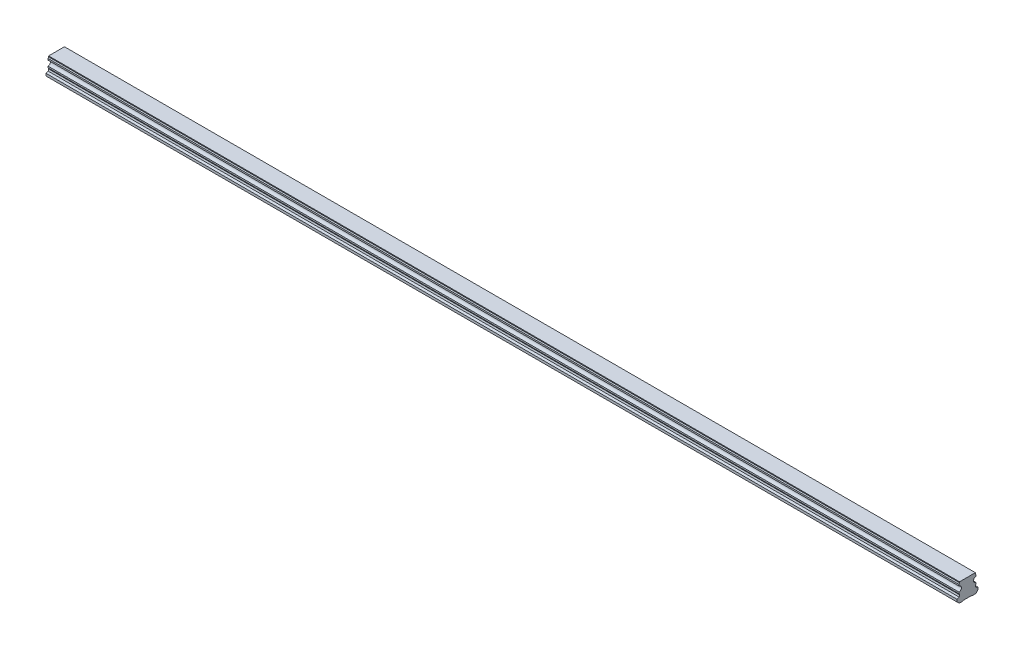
ISO-10303-21;
HEADER;
FILE_DESCRIPTION(('STEP AP214'),'2;1');
FILE_NAME('part.step','',(''),(''),'','','');
FILE_SCHEMA(('AUTOMOTIVE_DESIGN { 1 0 10303 214 1 1 1 1 }'));
ENDSEC;
DATA;
#1=APPLICATION_CONTEXT('core data for automotive mechanical design processes');
#2=APPLICATION_PROTOCOL_DEFINITION('international standard','automotive_design',2000,#1);
#3=PRODUCT_CONTEXT('',#1,'mechanical');
#4=PRODUCT('Part','Part','',(#3));
#5=PRODUCT_RELATED_PRODUCT_CATEGORY('part','',(#4));
#6=PRODUCT_DEFINITION_FORMATION('','',#4);
#7=PRODUCT_DEFINITION_CONTEXT('part definition',#1,'design');
#8=PRODUCT_DEFINITION('design','',#6,#7);
#9=PRODUCT_DEFINITION_SHAPE('','',#8);
#10=(LENGTH_UNIT() NAMED_UNIT(*) SI_UNIT(.MILLI.,.METRE.));
#11=(NAMED_UNIT(*) PLANE_ANGLE_UNIT() SI_UNIT($,.RADIAN.));
#12=(NAMED_UNIT(*) SI_UNIT($,.STERADIAN.) SOLID_ANGLE_UNIT());
#13=UNCERTAINTY_MEASURE_WITH_UNIT(LENGTH_MEASURE(1.E-05),#10,'distance_accuracy_value','');
#14=(GEOMETRIC_REPRESENTATION_CONTEXT(3) GLOBAL_UNCERTAINTY_ASSIGNED_CONTEXT((#13)) GLOBAL_UNIT_ASSIGNED_CONTEXT((#10,
#11,#12)) REPRESENTATION_CONTEXT('',''));
#15=CARTESIAN_POINT('',(0.,0.,0.));
#16=DIRECTION('',(0.,0.,1.));
#17=DIRECTION('',(1.,0.,0.));
#18=AXIS2_PLACEMENT_3D('',#15,#16,#17);
#19=CARTESIAN_POINT('',(1050.,0.499999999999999,0.));
#20=DIRECTION('',(0.,-1.,0.));
#21=DIRECTION('',(0.,0.,-1.));
#22=AXIS2_PLACEMENT_3D('',#19,#20,#21);
#23=CONICAL_SURFACE('',#22,3.5,0.785398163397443);
#24=CARTESIAN_POINT('',(1050.,1.00000000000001,0.));
#25=DIRECTION('',(0.,1.,0.));
#26=DIRECTION('',(0.,0.,1.));
#27=AXIS2_PLACEMENT_3D('',#24,#25,#26);
#28=CIRCLE('',#27,3.);
#29=CARTESIAN_POINT('',(1050.,1.00000000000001,3.));
#30=VERTEX_POINT('',#29);
#31=EDGE_CURVE('E11',#30,#30,#28,.F.);
#32=ORIENTED_EDGE('',*,*,#31,.F.);
#33=EDGE_LOOP('',(#32));
#34=FACE_BOUND('',#33,.T.);
#35=CARTESIAN_POINT('',(1050.,0.499999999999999,0.));
#36=DIRECTION('',(0.,1.,0.));
#37=DIRECTION('',(0.,0.,1.));
#38=AXIS2_PLACEMENT_3D('',#35,#36,#37);
#39=CIRCLE('',#38,3.5);
#40=CARTESIAN_POINT('',(1050.,0.5,3.5));
#41=VERTEX_POINT('',#40);
#42=EDGE_CURVE('E613',#41,#41,#39,.T.);
#43=ORIENTED_EDGE('',*,*,#42,.F.);
#44=EDGE_LOOP('',(#43));
#45=FACE_BOUND('',#44,.T.);
#46=ADVANCED_FACE('F39',(#34,#45),#23,.F.);
#47=CARTESIAN_POINT('',(1050.,12.,0.));
#48=DIRECTION('',(0.,-1.,0.));
#49=DIRECTION('',(0.,0.,-1.));
#50=AXIS2_PLACEMENT_3D('',#47,#48,#49);
#51=CYLINDRICAL_SURFACE('',#50,3.);
#52=ORIENTED_EDGE('',*,*,#31,.T.);
#53=EDGE_LOOP('',(#52));
#54=FACE_BOUND('',#53,.T.);
#55=CARTESIAN_POINT('',(1050.,12.,0.));
#56=DIRECTION('',(0.,-1.,0.));
#57=DIRECTION('',(0.,0.,-1.));
#58=AXIS2_PLACEMENT_3D('',#55,#56,#57);
#59=CIRCLE('',#58,3.);
#60=CARTESIAN_POINT('',(1050.,12.,-3.));
#61=VERTEX_POINT('',#60);
#62=EDGE_CURVE('E49',#61,#61,#59,.T.);
#63=ORIENTED_EDGE('',*,*,#62,.F.);
#64=EDGE_LOOP('',(#63));
#65=FACE_BOUND('',#64,.T.);
#66=ADVANCED_FACE('F872',(#54,#65),#51,.F.);
#67=CARTESIAN_POINT('',(1050.,12.,0.));
#68=DIRECTION('',(0.,-1.,0.));
#69=DIRECTION('',(0.,0.,-1.));
#70=AXIS2_PLACEMENT_3D('',#67,#68,#69);
#71=PLANE('',#70);
#72=CARTESIAN_POINT('',(1050.,12.,0.));
#73=DIRECTION('',(0.,-1.,0.));
#74=DIRECTION('',(0.,0.,-1.));
#75=AXIS2_PLACEMENT_3D('',#72,#73,#74);
#76=CIRCLE('',#75,2.5);
#77=CARTESIAN_POINT('',(1050.,12.,-2.5));
#78=VERTEX_POINT('',#77);
#79=EDGE_CURVE('E42',#78,#78,#76,.T.);
#80=ORIENTED_EDGE('',*,*,#79,.F.);
#81=EDGE_LOOP('',(#80));
#82=FACE_BOUND('',#81,.T.);
#83=ORIENTED_EDGE('',*,*,#62,.T.);
#84=EDGE_LOOP('',(#83));
#85=FACE_BOUND('',#84,.T.);
#86=ADVANCED_FACE('F877',(#82,#85),#71,.T.);
#87=CARTESIAN_POINT('',(990.,0.499999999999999,0.));
#88=DIRECTION('',(0.,-1.,0.));
#89=DIRECTION('',(0.,0.,-1.));
#90=AXIS2_PLACEMENT_3D('',#87,#88,#89);
#91=CONICAL_SURFACE('',#90,3.5,0.785398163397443);
#92=CARTESIAN_POINT('',(990.,1.00000000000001,0.));
#93=DIRECTION('',(0.,1.,0.));
#94=DIRECTION('',(0.,0.,1.));
#95=AXIS2_PLACEMENT_3D('',#92,#93,#94);
#96=CIRCLE('',#95,3.);
#97=CARTESIAN_POINT('',(990.,1.00000000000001,3.));
#98=VERTEX_POINT('',#97);
#99=EDGE_CURVE('E609',#98,#98,#96,.F.);
#100=ORIENTED_EDGE('',*,*,#99,.F.);
#101=EDGE_LOOP('',(#100));
#102=FACE_BOUND('',#101,.T.);
#103=CARTESIAN_POINT('',(990.,0.499999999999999,0.));
#104=DIRECTION('',(0.,1.,0.));
#105=DIRECTION('',(0.,0.,1.));
#106=AXIS2_PLACEMENT_3D('',#103,#104,#105);
#107=CIRCLE('',#106,3.5);
#108=CARTESIAN_POINT('',(990.,0.5,3.5));
#109=VERTEX_POINT('',#108);
#110=EDGE_CURVE('E601',#109,#109,#107,.T.);
#111=ORIENTED_EDGE('',*,*,#110,.F.);
#112=EDGE_LOOP('',(#111));
#113=FACE_BOUND('',#112,.T.);
#114=ADVANCED_FACE('F1132',(#102,#113),#91,.F.);
#115=CARTESIAN_POINT('',(990.,12.,0.));
#116=DIRECTION('',(0.,-1.,0.));
#117=DIRECTION('',(0.,0.,-1.));
#118=AXIS2_PLACEMENT_3D('',#115,#116,#117);
#119=CYLINDRICAL_SURFACE('',#118,3.);
#120=ORIENTED_EDGE('',*,*,#99,.T.);
#121=EDGE_LOOP('',(#120));
#122=FACE_BOUND('',#121,.T.);
#123=CARTESIAN_POINT('',(990.,12.,0.));
#124=DIRECTION('',(0.,-1.,0.));
#125=DIRECTION('',(0.,0.,-1.));
#126=AXIS2_PLACEMENT_3D('',#123,#124,#125);
#127=CIRCLE('',#126,3.);
#128=CARTESIAN_POINT('',(990.,12.,-3.));
#129=VERTEX_POINT('',#128);
#130=EDGE_CURVE('E605',#129,#129,#127,.T.);
#131=ORIENTED_EDGE('',*,*,#130,.F.);
#132=EDGE_LOOP('',(#131));
#133=FACE_BOUND('',#132,.T.);
#134=ADVANCED_FACE('F1128',(#122,#133),#119,.F.);
#135=CARTESIAN_POINT('',(990.,12.,0.));
#136=DIRECTION('',(0.,-1.,0.));
#137=DIRECTION('',(0.,0.,-1.));
#138=AXIS2_PLACEMENT_3D('',#135,#136,#137);
#139=PLANE('',#138);
#140=CARTESIAN_POINT('',(990.,12.,0.));
#141=DIRECTION('',(0.,-1.,0.));
#142=DIRECTION('',(0.,0.,-1.));
#143=AXIS2_PLACEMENT_3D('',#140,#141,#142);
#144=CIRCLE('',#143,2.5);
#145=CARTESIAN_POINT('',(990.,12.,-2.5));
#146=VERTEX_POINT('',#145);
#147=EDGE_CURVE('E680',#146,#146,#144,.T.);
#148=ORIENTED_EDGE('',*,*,#147,.F.);
#149=EDGE_LOOP('',(#148));
#150=FACE_BOUND('',#149,.T.);
#151=ORIENTED_EDGE('',*,*,#130,.T.);
#152=EDGE_LOOP('',(#151));
#153=FACE_BOUND('',#152,.T.);
#154=ADVANCED_FACE('F1124',(#150,#153),#139,.T.);
#155=CARTESIAN_POINT('',(930.,0.499999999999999,0.));
#156=DIRECTION('',(0.,-1.,0.));
#157=DIRECTION('',(0.,0.,-1.));
#158=AXIS2_PLACEMENT_3D('',#155,#156,#157);
#159=CONICAL_SURFACE('',#158,3.5,0.785398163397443);
#160=CARTESIAN_POINT('',(930.,1.00000000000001,0.));
#161=DIRECTION('',(0.,1.,0.));
#162=DIRECTION('',(0.,0.,1.));
#163=AXIS2_PLACEMENT_3D('',#160,#161,#162);
#164=CIRCLE('',#163,3.);
#165=CARTESIAN_POINT('',(930.,1.00000000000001,3.));
#166=VERTEX_POINT('',#165);
#167=EDGE_CURVE('E597',#166,#166,#164,.F.);
#168=ORIENTED_EDGE('',*,*,#167,.F.);
#169=EDGE_LOOP('',(#168));
#170=FACE_BOUND('',#169,.T.);
#171=CARTESIAN_POINT('',(930.,0.499999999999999,0.));
#172=DIRECTION('',(0.,1.,0.));
#173=DIRECTION('',(0.,0.,1.));
#174=AXIS2_PLACEMENT_3D('',#171,#172,#173);
#175=CIRCLE('',#174,3.5);
#176=CARTESIAN_POINT('',(930.,0.5,3.5));
#177=VERTEX_POINT('',#176);
#178=EDGE_CURVE('E589',#177,#177,#175,.T.);
#179=ORIENTED_EDGE('',*,*,#178,.F.);
#180=EDGE_LOOP('',(#179));
#181=FACE_BOUND('',#180,.T.);
#182=ADVANCED_FACE('F1120',(#170,#181),#159,.F.);
#183=CARTESIAN_POINT('',(930.,12.,0.));
#184=DIRECTION('',(0.,-1.,0.));
#185=DIRECTION('',(0.,0.,-1.));
#186=AXIS2_PLACEMENT_3D('',#183,#184,#185);
#187=CYLINDRICAL_SURFACE('',#186,3.);
#188=ORIENTED_EDGE('',*,*,#167,.T.);
#189=EDGE_LOOP('',(#188));
#190=FACE_BOUND('',#189,.T.);
#191=CARTESIAN_POINT('',(930.,12.,0.));
#192=DIRECTION('',(0.,-1.,0.));
#193=DIRECTION('',(0.,0.,-1.));
#194=AXIS2_PLACEMENT_3D('',#191,#192,#193);
#195=CIRCLE('',#194,3.);
#196=CARTESIAN_POINT('',(930.,12.,-3.));
#197=VERTEX_POINT('',#196);
#198=EDGE_CURVE('E593',#197,#197,#195,.T.);
#199=ORIENTED_EDGE('',*,*,#198,.F.);
#200=EDGE_LOOP('',(#199));
#201=FACE_BOUND('',#200,.T.);
#202=ADVANCED_FACE('F1116',(#190,#201),#187,.F.);
#203=CARTESIAN_POINT('',(930.,12.,0.));
#204=DIRECTION('',(0.,-1.,0.));
#205=DIRECTION('',(0.,0.,-1.));
#206=AXIS2_PLACEMENT_3D('',#203,#204,#205);
#207=PLANE('',#206);
#208=CARTESIAN_POINT('',(930.,12.,0.));
#209=DIRECTION('',(0.,-1.,0.));
#210=DIRECTION('',(0.,0.,-1.));
#211=AXIS2_PLACEMENT_3D('',#208,#209,#210);
#212=CIRCLE('',#211,2.5);
#213=CARTESIAN_POINT('',(930.,12.,-2.5));
#214=VERTEX_POINT('',#213);
#215=EDGE_CURVE('E677',#214,#214,#212,.T.);
#216=ORIENTED_EDGE('',*,*,#215,.F.);
#217=EDGE_LOOP('',(#216));
#218=FACE_BOUND('',#217,.T.);
#219=ORIENTED_EDGE('',*,*,#198,.T.);
#220=EDGE_LOOP('',(#219));
#221=FACE_BOUND('',#220,.T.);
#222=ADVANCED_FACE('F1112',(#218,#221),#207,.T.);
#223=CARTESIAN_POINT('',(870.,0.499999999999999,0.));
#224=DIRECTION('',(0.,-1.,0.));
#225=DIRECTION('',(0.,0.,-1.));
#226=AXIS2_PLACEMENT_3D('',#223,#224,#225);
#227=CONICAL_SURFACE('',#226,3.5,0.785398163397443);
#228=CARTESIAN_POINT('',(870.,1.00000000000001,0.));
#229=DIRECTION('',(0.,1.,0.));
#230=DIRECTION('',(0.,0.,1.));
#231=AXIS2_PLACEMENT_3D('',#228,#229,#230);
#232=CIRCLE('',#231,3.);
#233=CARTESIAN_POINT('',(870.,1.00000000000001,3.));
#234=VERTEX_POINT('',#233);
#235=EDGE_CURVE('E585',#234,#234,#232,.F.);
#236=ORIENTED_EDGE('',*,*,#235,.F.);
#237=EDGE_LOOP('',(#236));
#238=FACE_BOUND('',#237,.T.);
#239=CARTESIAN_POINT('',(870.,0.499999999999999,0.));
#240=DIRECTION('',(0.,1.,0.));
#241=DIRECTION('',(0.,0.,1.));
#242=AXIS2_PLACEMENT_3D('',#239,#240,#241);
#243=CIRCLE('',#242,3.5);
#244=CARTESIAN_POINT('',(870.,0.5,3.5));
#245=VERTEX_POINT('',#244);
#246=EDGE_CURVE('E577',#245,#245,#243,.T.);
#247=ORIENTED_EDGE('',*,*,#246,.F.);
#248=EDGE_LOOP('',(#247));
#249=FACE_BOUND('',#248,.T.);
#250=ADVANCED_FACE('F1108',(#238,#249),#227,.F.);
#251=CARTESIAN_POINT('',(870.,12.,0.));
#252=DIRECTION('',(0.,-1.,0.));
#253=DIRECTION('',(0.,0.,-1.));
#254=AXIS2_PLACEMENT_3D('',#251,#252,#253);
#255=CYLINDRICAL_SURFACE('',#254,3.);
#256=ORIENTED_EDGE('',*,*,#235,.T.);
#257=EDGE_LOOP('',(#256));
#258=FACE_BOUND('',#257,.T.);
#259=CARTESIAN_POINT('',(870.,12.,0.));
#260=DIRECTION('',(0.,-1.,0.));
#261=DIRECTION('',(0.,0.,-1.));
#262=AXIS2_PLACEMENT_3D('',#259,#260,#261);
#263=CIRCLE('',#262,3.);
#264=CARTESIAN_POINT('',(870.,12.,-3.));
#265=VERTEX_POINT('',#264);
#266=EDGE_CURVE('E581',#265,#265,#263,.T.);
#267=ORIENTED_EDGE('',*,*,#266,.F.);
#268=EDGE_LOOP('',(#267));
#269=FACE_BOUND('',#268,.T.);
#270=ADVANCED_FACE('F1104',(#258,#269),#255,.F.);
#271=CARTESIAN_POINT('',(870.,12.,0.));
#272=DIRECTION('',(0.,-1.,0.));
#273=DIRECTION('',(0.,0.,-1.));
#274=AXIS2_PLACEMENT_3D('',#271,#272,#273);
#275=PLANE('',#274);
#276=CARTESIAN_POINT('',(870.,12.,0.));
#277=DIRECTION('',(0.,-1.,0.));
#278=DIRECTION('',(0.,0.,-1.));
#279=AXIS2_PLACEMENT_3D('',#276,#277,#278);
#280=CIRCLE('',#279,2.5);
#281=CARTESIAN_POINT('',(870.,12.,-2.5));
#282=VERTEX_POINT('',#281);
#283=EDGE_CURVE('E673',#282,#282,#280,.T.);
#284=ORIENTED_EDGE('',*,*,#283,.F.);
#285=EDGE_LOOP('',(#284));
#286=FACE_BOUND('',#285,.T.);
#287=ORIENTED_EDGE('',*,*,#266,.T.);
#288=EDGE_LOOP('',(#287));
#289=FACE_BOUND('',#288,.T.);
#290=ADVANCED_FACE('F1100',(#286,#289),#275,.T.);
#291=CARTESIAN_POINT('',(810.,0.499999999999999,0.));
#292=DIRECTION('',(0.,-1.,0.));
#293=DIRECTION('',(0.,0.,-1.));
#294=AXIS2_PLACEMENT_3D('',#291,#292,#293);
#295=CONICAL_SURFACE('',#294,3.5,0.785398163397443);
#296=CARTESIAN_POINT('',(810.,1.00000000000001,0.));
#297=DIRECTION('',(0.,1.,0.));
#298=DIRECTION('',(0.,0.,1.));
#299=AXIS2_PLACEMENT_3D('',#296,#297,#298);
#300=CIRCLE('',#299,3.);
#301=CARTESIAN_POINT('',(810.,1.00000000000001,3.));
#302=VERTEX_POINT('',#301);
#303=EDGE_CURVE('E573',#302,#302,#300,.F.);
#304=ORIENTED_EDGE('',*,*,#303,.F.);
#305=EDGE_LOOP('',(#304));
#306=FACE_BOUND('',#305,.T.);
#307=CARTESIAN_POINT('',(810.,0.499999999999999,0.));
#308=DIRECTION('',(0.,1.,0.));
#309=DIRECTION('',(0.,0.,1.));
#310=AXIS2_PLACEMENT_3D('',#307,#308,#309);
#311=CIRCLE('',#310,3.5);
#312=CARTESIAN_POINT('',(810.,0.5,3.5));
#313=VERTEX_POINT('',#312);
#314=EDGE_CURVE('E565',#313,#313,#311,.T.);
#315=ORIENTED_EDGE('',*,*,#314,.F.);
#316=EDGE_LOOP('',(#315));
#317=FACE_BOUND('',#316,.T.);
#318=ADVANCED_FACE('F1096',(#306,#317),#295,.F.);
#319=CARTESIAN_POINT('',(810.,12.,0.));
#320=DIRECTION('',(0.,-1.,0.));
#321=DIRECTION('',(0.,0.,-1.));
#322=AXIS2_PLACEMENT_3D('',#319,#320,#321);
#323=CYLINDRICAL_SURFACE('',#322,3.);
#324=ORIENTED_EDGE('',*,*,#303,.T.);
#325=EDGE_LOOP('',(#324));
#326=FACE_BOUND('',#325,.T.);
#327=CARTESIAN_POINT('',(810.,12.,0.));
#328=DIRECTION('',(0.,-1.,0.));
#329=DIRECTION('',(0.,0.,-1.));
#330=AXIS2_PLACEMENT_3D('',#327,#328,#329);
#331=CIRCLE('',#330,3.);
#332=CARTESIAN_POINT('',(810.,12.,-3.));
#333=VERTEX_POINT('',#332);
#334=EDGE_CURVE('E569',#333,#333,#331,.T.);
#335=ORIENTED_EDGE('',*,*,#334,.F.);
#336=EDGE_LOOP('',(#335));
#337=FACE_BOUND('',#336,.T.);
#338=ADVANCED_FACE('F1092',(#326,#337),#323,.F.);
#339=CARTESIAN_POINT('',(810.,12.,0.));
#340=DIRECTION('',(0.,-1.,0.));
#341=DIRECTION('',(0.,0.,-1.));
#342=AXIS2_PLACEMENT_3D('',#339,#340,#341);
#343=PLANE('',#342);
#344=CARTESIAN_POINT('',(810.,12.,0.));
#345=DIRECTION('',(0.,-1.,0.));
#346=DIRECTION('',(0.,0.,-1.));
#347=AXIS2_PLACEMENT_3D('',#344,#345,#346);
#348=CIRCLE('',#347,2.5);
#349=CARTESIAN_POINT('',(810.,12.,-2.5));
#350=VERTEX_POINT('',#349);
#351=EDGE_CURVE('E669',#350,#350,#348,.T.);
#352=ORIENTED_EDGE('',*,*,#351,.F.);
#353=EDGE_LOOP('',(#352));
#354=FACE_BOUND('',#353,.T.);
#355=ORIENTED_EDGE('',*,*,#334,.T.);
#356=EDGE_LOOP('',(#355));
#357=FACE_BOUND('',#356,.T.);
#358=ADVANCED_FACE('F1088',(#354,#357),#343,.T.);
#359=CARTESIAN_POINT('',(750.,0.499999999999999,0.));
#360=DIRECTION('',(0.,-1.,0.));
#361=DIRECTION('',(0.,0.,-1.));
#362=AXIS2_PLACEMENT_3D('',#359,#360,#361);
#363=CONICAL_SURFACE('',#362,3.5,0.785398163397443);
#364=CARTESIAN_POINT('',(750.,1.00000000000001,0.));
#365=DIRECTION('',(0.,1.,0.));
#366=DIRECTION('',(0.,0.,1.));
#367=AXIS2_PLACEMENT_3D('',#364,#365,#366);
#368=CIRCLE('',#367,3.);
#369=CARTESIAN_POINT('',(750.,1.00000000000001,3.));
#370=VERTEX_POINT('',#369);
#371=EDGE_CURVE('E561',#370,#370,#368,.F.);
#372=ORIENTED_EDGE('',*,*,#371,.F.);
#373=EDGE_LOOP('',(#372));
#374=FACE_BOUND('',#373,.T.);
#375=CARTESIAN_POINT('',(750.,0.499999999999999,0.));
#376=DIRECTION('',(0.,1.,0.));
#377=DIRECTION('',(0.,0.,1.));
#378=AXIS2_PLACEMENT_3D('',#375,#376,#377);
#379=CIRCLE('',#378,3.5);
#380=CARTESIAN_POINT('',(750.,0.5,3.5));
#381=VERTEX_POINT('',#380);
#382=EDGE_CURVE('E553',#381,#381,#379,.T.);
#383=ORIENTED_EDGE('',*,*,#382,.F.);
#384=EDGE_LOOP('',(#383));
#385=FACE_BOUND('',#384,.T.);
#386=ADVANCED_FACE('F1084',(#374,#385),#363,.F.);
#387=CARTESIAN_POINT('',(750.,12.,0.));
#388=DIRECTION('',(0.,-1.,0.));
#389=DIRECTION('',(0.,0.,-1.));
#390=AXIS2_PLACEMENT_3D('',#387,#388,#389);
#391=CYLINDRICAL_SURFACE('',#390,3.);
#392=ORIENTED_EDGE('',*,*,#371,.T.);
#393=EDGE_LOOP('',(#392));
#394=FACE_BOUND('',#393,.T.);
#395=CARTESIAN_POINT('',(750.,12.,0.));
#396=DIRECTION('',(0.,-1.,0.));
#397=DIRECTION('',(0.,0.,-1.));
#398=AXIS2_PLACEMENT_3D('',#395,#396,#397);
#399=CIRCLE('',#398,3.);
#400=CARTESIAN_POINT('',(750.,12.,-3.));
#401=VERTEX_POINT('',#400);
#402=EDGE_CURVE('E557',#401,#401,#399,.T.);
#403=ORIENTED_EDGE('',*,*,#402,.F.);
#404=EDGE_LOOP('',(#403));
#405=FACE_BOUND('',#404,.T.);
#406=ADVANCED_FACE('F1080',(#394,#405),#391,.F.);
#407=CARTESIAN_POINT('',(750.,12.,0.));
#408=DIRECTION('',(0.,-1.,0.));
#409=DIRECTION('',(0.,0.,-1.));
#410=AXIS2_PLACEMENT_3D('',#407,#408,#409);
#411=PLANE('',#410);
#412=CARTESIAN_POINT('',(750.,12.,0.));
#413=DIRECTION('',(0.,-1.,0.));
#414=DIRECTION('',(0.,0.,-1.));
#415=AXIS2_PLACEMENT_3D('',#412,#413,#414);
#416=CIRCLE('',#415,2.5);
#417=CARTESIAN_POINT('',(750.,12.,-2.5));
#418=VERTEX_POINT('',#417);
#419=EDGE_CURVE('E665',#418,#418,#416,.T.);
#420=ORIENTED_EDGE('',*,*,#419,.F.);
#421=EDGE_LOOP('',(#420));
#422=FACE_BOUND('',#421,.T.);
#423=ORIENTED_EDGE('',*,*,#402,.T.);
#424=EDGE_LOOP('',(#423));
#425=FACE_BOUND('',#424,.T.);
#426=ADVANCED_FACE('F1076',(#422,#425),#411,.T.);
#427=CARTESIAN_POINT('',(690.,0.499999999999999,0.));
#428=DIRECTION('',(0.,-1.,0.));
#429=DIRECTION('',(0.,0.,-1.));
#430=AXIS2_PLACEMENT_3D('',#427,#428,#429);
#431=CONICAL_SURFACE('',#430,3.5,0.785398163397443);
#432=CARTESIAN_POINT('',(690.,1.00000000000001,0.));
#433=DIRECTION('',(0.,1.,0.));
#434=DIRECTION('',(0.,0.,1.));
#435=AXIS2_PLACEMENT_3D('',#432,#433,#434);
#436=CIRCLE('',#435,3.);
#437=CARTESIAN_POINT('',(690.,1.00000000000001,3.));
#438=VERTEX_POINT('',#437);
#439=EDGE_CURVE('E549',#438,#438,#436,.F.);
#440=ORIENTED_EDGE('',*,*,#439,.F.);
#441=EDGE_LOOP('',(#440));
#442=FACE_BOUND('',#441,.T.);
#443=CARTESIAN_POINT('',(690.,0.499999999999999,0.));
#444=DIRECTION('',(0.,1.,0.));
#445=DIRECTION('',(0.,0.,1.));
#446=AXIS2_PLACEMENT_3D('',#443,#444,#445);
#447=CIRCLE('',#446,3.5);
#448=CARTESIAN_POINT('',(690.,0.5,3.5));
#449=VERTEX_POINT('',#448);
#450=EDGE_CURVE('E541',#449,#449,#447,.T.);
#451=ORIENTED_EDGE('',*,*,#450,.F.);
#452=EDGE_LOOP('',(#451));
#453=FACE_BOUND('',#452,.T.);
#454=ADVANCED_FACE('F1072',(#442,#453),#431,.F.);
#455=CARTESIAN_POINT('',(690.,12.,0.));
#456=DIRECTION('',(0.,-1.,0.));
#457=DIRECTION('',(0.,0.,-1.));
#458=AXIS2_PLACEMENT_3D('',#455,#456,#457);
#459=CYLINDRICAL_SURFACE('',#458,3.);
#460=ORIENTED_EDGE('',*,*,#439,.T.);
#461=EDGE_LOOP('',(#460));
#462=FACE_BOUND('',#461,.T.);
#463=CARTESIAN_POINT('',(690.,12.,0.));
#464=DIRECTION('',(0.,-1.,0.));
#465=DIRECTION('',(0.,0.,-1.));
#466=AXIS2_PLACEMENT_3D('',#463,#464,#465);
#467=CIRCLE('',#466,3.);
#468=CARTESIAN_POINT('',(690.,12.,-3.));
#469=VERTEX_POINT('',#468);
#470=EDGE_CURVE('E545',#469,#469,#467,.T.);
#471=ORIENTED_EDGE('',*,*,#470,.F.);
#472=EDGE_LOOP('',(#471));
#473=FACE_BOUND('',#472,.T.);
#474=ADVANCED_FACE('F1068',(#462,#473),#459,.F.);
#475=CARTESIAN_POINT('',(690.,12.,0.));
#476=DIRECTION('',(0.,-1.,0.));
#477=DIRECTION('',(0.,0.,-1.));
#478=AXIS2_PLACEMENT_3D('',#475,#476,#477);
#479=PLANE('',#478);
#480=CARTESIAN_POINT('',(690.,12.,0.));
#481=DIRECTION('',(0.,-1.,0.));
#482=DIRECTION('',(0.,0.,-1.));
#483=AXIS2_PLACEMENT_3D('',#480,#481,#482);
#484=CIRCLE('',#483,2.5);
#485=CARTESIAN_POINT('',(690.,12.,-2.5));
#486=VERTEX_POINT('',#485);
#487=EDGE_CURVE('E661',#486,#486,#484,.T.);
#488=ORIENTED_EDGE('',*,*,#487,.F.);
#489=EDGE_LOOP('',(#488));
#490=FACE_BOUND('',#489,.T.);
#491=ORIENTED_EDGE('',*,*,#470,.T.);
#492=EDGE_LOOP('',(#491));
#493=FACE_BOUND('',#492,.T.);
#494=ADVANCED_FACE('F1064',(#490,#493),#479,.T.);
#495=CARTESIAN_POINT('',(630.,0.499999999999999,0.));
#496=DIRECTION('',(0.,-1.,0.));
#497=DIRECTION('',(0.,0.,-1.));
#498=AXIS2_PLACEMENT_3D('',#495,#496,#497);
#499=CONICAL_SURFACE('',#498,3.5,0.785398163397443);
#500=CARTESIAN_POINT('',(630.,1.00000000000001,0.));
#501=DIRECTION('',(0.,1.,0.));
#502=DIRECTION('',(0.,0.,1.));
#503=AXIS2_PLACEMENT_3D('',#500,#501,#502);
#504=CIRCLE('',#503,3.);
#505=CARTESIAN_POINT('',(630.,1.00000000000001,3.));
#506=VERTEX_POINT('',#505);
#507=EDGE_CURVE('E537',#506,#506,#504,.F.);
#508=ORIENTED_EDGE('',*,*,#507,.F.);
#509=EDGE_LOOP('',(#508));
#510=FACE_BOUND('',#509,.T.);
#511=CARTESIAN_POINT('',(630.,0.499999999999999,0.));
#512=DIRECTION('',(0.,1.,0.));
#513=DIRECTION('',(0.,0.,1.));
#514=AXIS2_PLACEMENT_3D('',#511,#512,#513);
#515=CIRCLE('',#514,3.5);
#516=CARTESIAN_POINT('',(630.,0.5,3.5));
#517=VERTEX_POINT('',#516);
#518=EDGE_CURVE('E529',#517,#517,#515,.T.);
#519=ORIENTED_EDGE('',*,*,#518,.F.);
#520=EDGE_LOOP('',(#519));
#521=FACE_BOUND('',#520,.T.);
#522=ADVANCED_FACE('F1060',(#510,#521),#499,.F.);
#523=CARTESIAN_POINT('',(630.,12.,0.));
#524=DIRECTION('',(0.,-1.,0.));
#525=DIRECTION('',(0.,0.,-1.));
#526=AXIS2_PLACEMENT_3D('',#523,#524,#525);
#527=CYLINDRICAL_SURFACE('',#526,3.);
#528=ORIENTED_EDGE('',*,*,#507,.T.);
#529=EDGE_LOOP('',(#528));
#530=FACE_BOUND('',#529,.T.);
#531=CARTESIAN_POINT('',(630.,12.,0.));
#532=DIRECTION('',(0.,-1.,0.));
#533=DIRECTION('',(0.,0.,-1.));
#534=AXIS2_PLACEMENT_3D('',#531,#532,#533);
#535=CIRCLE('',#534,3.);
#536=CARTESIAN_POINT('',(630.,12.,-3.));
#537=VERTEX_POINT('',#536);
#538=EDGE_CURVE('E533',#537,#537,#535,.T.);
#539=ORIENTED_EDGE('',*,*,#538,.F.);
#540=EDGE_LOOP('',(#539));
#541=FACE_BOUND('',#540,.T.);
#542=ADVANCED_FACE('F1056',(#530,#541),#527,.F.);
#543=CARTESIAN_POINT('',(630.,12.,0.));
#544=DIRECTION('',(0.,-1.,0.));
#545=DIRECTION('',(0.,0.,-1.));
#546=AXIS2_PLACEMENT_3D('',#543,#544,#545);
#547=PLANE('',#546);
#548=CARTESIAN_POINT('',(630.,12.,0.));
#549=DIRECTION('',(0.,-1.,0.));
#550=DIRECTION('',(0.,0.,-1.));
#551=AXIS2_PLACEMENT_3D('',#548,#549,#550);
#552=CIRCLE('',#551,2.5);
#553=CARTESIAN_POINT('',(630.,12.,-2.5));
#554=VERTEX_POINT('',#553);
#555=EDGE_CURVE('E657',#554,#554,#552,.T.);
#556=ORIENTED_EDGE('',*,*,#555,.F.);
#557=EDGE_LOOP('',(#556));
#558=FACE_BOUND('',#557,.T.);
#559=ORIENTED_EDGE('',*,*,#538,.T.);
#560=EDGE_LOOP('',(#559));
#561=FACE_BOUND('',#560,.T.);
#562=ADVANCED_FACE('F1052',(#558,#561),#547,.T.);
#563=CARTESIAN_POINT('',(570.,0.499999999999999,0.));
#564=DIRECTION('',(0.,-1.,0.));
#565=DIRECTION('',(0.,0.,-1.));
#566=AXIS2_PLACEMENT_3D('',#563,#564,#565);
#567=CONICAL_SURFACE('',#566,3.5,0.785398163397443);
#568=CARTESIAN_POINT('',(570.,1.00000000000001,0.));
#569=DIRECTION('',(0.,1.,0.));
#570=DIRECTION('',(0.,0.,1.));
#571=AXIS2_PLACEMENT_3D('',#568,#569,#570);
#572=CIRCLE('',#571,3.);
#573=CARTESIAN_POINT('',(570.,1.00000000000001,3.));
#574=VERTEX_POINT('',#573);
#575=EDGE_CURVE('E525',#574,#574,#572,.F.);
#576=ORIENTED_EDGE('',*,*,#575,.F.);
#577=EDGE_LOOP('',(#576));
#578=FACE_BOUND('',#577,.T.);
#579=CARTESIAN_POINT('',(570.,0.499999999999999,0.));
#580=DIRECTION('',(0.,1.,0.));
#581=DIRECTION('',(0.,0.,1.));
#582=AXIS2_PLACEMENT_3D('',#579,#580,#581);
#583=CIRCLE('',#582,3.5);
#584=CARTESIAN_POINT('',(570.,0.5,3.5));
#585=VERTEX_POINT('',#584);
#586=EDGE_CURVE('E517',#585,#585,#583,.T.);
#587=ORIENTED_EDGE('',*,*,#586,.F.);
#588=EDGE_LOOP('',(#587));
#589=FACE_BOUND('',#588,.T.);
#590=ADVANCED_FACE('F1048',(#578,#589),#567,.F.);
#591=CARTESIAN_POINT('',(570.,12.,0.));
#592=DIRECTION('',(0.,-1.,0.));
#593=DIRECTION('',(0.,0.,-1.));
#594=AXIS2_PLACEMENT_3D('',#591,#592,#593);
#595=CYLINDRICAL_SURFACE('',#594,3.);
#596=ORIENTED_EDGE('',*,*,#575,.T.);
#597=EDGE_LOOP('',(#596));
#598=FACE_BOUND('',#597,.T.);
#599=CARTESIAN_POINT('',(570.,12.,0.));
#600=DIRECTION('',(0.,-1.,0.));
#601=DIRECTION('',(0.,0.,-1.));
#602=AXIS2_PLACEMENT_3D('',#599,#600,#601);
#603=CIRCLE('',#602,3.);
#604=CARTESIAN_POINT('',(570.,12.,-3.));
#605=VERTEX_POINT('',#604);
#606=EDGE_CURVE('E521',#605,#605,#603,.T.);
#607=ORIENTED_EDGE('',*,*,#606,.F.);
#608=EDGE_LOOP('',(#607));
#609=FACE_BOUND('',#608,.T.);
#610=ADVANCED_FACE('F1044',(#598,#609),#595,.F.);
#611=CARTESIAN_POINT('',(570.,12.,0.));
#612=DIRECTION('',(0.,-1.,0.));
#613=DIRECTION('',(0.,0.,-1.));
#614=AXIS2_PLACEMENT_3D('',#611,#612,#613);
#615=PLANE('',#614);
#616=CARTESIAN_POINT('',(570.,12.,0.));
#617=DIRECTION('',(0.,-1.,0.));
#618=DIRECTION('',(0.,0.,-1.));
#619=AXIS2_PLACEMENT_3D('',#616,#617,#618);
#620=CIRCLE('',#619,2.5);
#621=CARTESIAN_POINT('',(570.,12.,-2.5));
#622=VERTEX_POINT('',#621);
#623=EDGE_CURVE('E653',#622,#622,#620,.T.);
#624=ORIENTED_EDGE('',*,*,#623,.F.);
#625=EDGE_LOOP('',(#624));
#626=FACE_BOUND('',#625,.T.);
#627=ORIENTED_EDGE('',*,*,#606,.T.);
#628=EDGE_LOOP('',(#627));
#629=FACE_BOUND('',#628,.T.);
#630=ADVANCED_FACE('F1040',(#626,#629),#615,.T.);
#631=CARTESIAN_POINT('',(510.,0.499999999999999,0.));
#632=DIRECTION('',(0.,-1.,0.));
#633=DIRECTION('',(0.,0.,-1.));
#634=AXIS2_PLACEMENT_3D('',#631,#632,#633);
#635=CONICAL_SURFACE('',#634,3.5,0.785398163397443);
#636=CARTESIAN_POINT('',(510.,1.00000000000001,0.));
#637=DIRECTION('',(0.,1.,0.));
#638=DIRECTION('',(0.,0.,1.));
#639=AXIS2_PLACEMENT_3D('',#636,#637,#638);
#640=CIRCLE('',#639,3.);
#641=CARTESIAN_POINT('',(510.,1.00000000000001,3.));
#642=VERTEX_POINT('',#641);
#643=EDGE_CURVE('E513',#642,#642,#640,.F.);
#644=ORIENTED_EDGE('',*,*,#643,.F.);
#645=EDGE_LOOP('',(#644));
#646=FACE_BOUND('',#645,.T.);
#647=CARTESIAN_POINT('',(510.,0.499999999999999,0.));
#648=DIRECTION('',(0.,1.,0.));
#649=DIRECTION('',(0.,0.,1.));
#650=AXIS2_PLACEMENT_3D('',#647,#648,#649);
#651=CIRCLE('',#650,3.5);
#652=CARTESIAN_POINT('',(510.,0.5,3.5));
#653=VERTEX_POINT('',#652);
#654=EDGE_CURVE('E505',#653,#653,#651,.T.);
#655=ORIENTED_EDGE('',*,*,#654,.F.);
#656=EDGE_LOOP('',(#655));
#657=FACE_BOUND('',#656,.T.);
#658=ADVANCED_FACE('F1036',(#646,#657),#635,.F.);
#659=CARTESIAN_POINT('',(510.,12.,0.));
#660=DIRECTION('',(0.,-1.,0.));
#661=DIRECTION('',(0.,0.,-1.));
#662=AXIS2_PLACEMENT_3D('',#659,#660,#661);
#663=CYLINDRICAL_SURFACE('',#662,3.);
#664=ORIENTED_EDGE('',*,*,#643,.T.);
#665=EDGE_LOOP('',(#664));
#666=FACE_BOUND('',#665,.T.);
#667=CARTESIAN_POINT('',(510.,12.,0.));
#668=DIRECTION('',(0.,-1.,0.));
#669=DIRECTION('',(0.,0.,-1.));
#670=AXIS2_PLACEMENT_3D('',#667,#668,#669);
#671=CIRCLE('',#670,3.);
#672=CARTESIAN_POINT('',(510.,12.,-3.));
#673=VERTEX_POINT('',#672);
#674=EDGE_CURVE('E509',#673,#673,#671,.T.);
#675=ORIENTED_EDGE('',*,*,#674,.F.);
#676=EDGE_LOOP('',(#675));
#677=FACE_BOUND('',#676,.T.);
#678=ADVANCED_FACE('F1032',(#666,#677),#663,.F.);
#679=CARTESIAN_POINT('',(510.,12.,0.));
#680=DIRECTION('',(0.,-1.,0.));
#681=DIRECTION('',(0.,0.,-1.));
#682=AXIS2_PLACEMENT_3D('',#679,#680,#681);
#683=PLANE('',#682);
#684=CARTESIAN_POINT('',(510.,12.,0.));
#685=DIRECTION('',(0.,-1.,0.));
#686=DIRECTION('',(0.,0.,-1.));
#687=AXIS2_PLACEMENT_3D('',#684,#685,#686);
#688=CIRCLE('',#687,2.5);
#689=CARTESIAN_POINT('',(510.,12.,-2.5));
#690=VERTEX_POINT('',#689);
#691=EDGE_CURVE('E649',#690,#690,#688,.T.);
#692=ORIENTED_EDGE('',*,*,#691,.F.);
#693=EDGE_LOOP('',(#692));
#694=FACE_BOUND('',#693,.T.);
#695=ORIENTED_EDGE('',*,*,#674,.T.);
#696=EDGE_LOOP('',(#695));
#697=FACE_BOUND('',#696,.T.);
#698=ADVANCED_FACE('F1028',(#694,#697),#683,.T.);
#699=CARTESIAN_POINT('',(450.,0.499999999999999,0.));
#700=DIRECTION('',(0.,-1.,0.));
#701=DIRECTION('',(0.,0.,-1.));
#702=AXIS2_PLACEMENT_3D('',#699,#700,#701);
#703=CONICAL_SURFACE('',#702,3.5,0.785398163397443);
#704=CARTESIAN_POINT('',(450.,1.00000000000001,0.));
#705=DIRECTION('',(0.,1.,0.));
#706=DIRECTION('',(0.,0.,1.));
#707=AXIS2_PLACEMENT_3D('',#704,#705,#706);
#708=CIRCLE('',#707,3.);
#709=CARTESIAN_POINT('',(450.,1.00000000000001,3.));
#710=VERTEX_POINT('',#709);
#711=EDGE_CURVE('E501',#710,#710,#708,.F.);
#712=ORIENTED_EDGE('',*,*,#711,.F.);
#713=EDGE_LOOP('',(#712));
#714=FACE_BOUND('',#713,.T.);
#715=CARTESIAN_POINT('',(450.,0.499999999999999,0.));
#716=DIRECTION('',(0.,1.,0.));
#717=DIRECTION('',(0.,0.,1.));
#718=AXIS2_PLACEMENT_3D('',#715,#716,#717);
#719=CIRCLE('',#718,3.5);
#720=CARTESIAN_POINT('',(450.,0.5,3.5));
#721=VERTEX_POINT('',#720);
#722=EDGE_CURVE('E493',#721,#721,#719,.T.);
#723=ORIENTED_EDGE('',*,*,#722,.F.);
#724=EDGE_LOOP('',(#723));
#725=FACE_BOUND('',#724,.T.);
#726=ADVANCED_FACE('F1024',(#714,#725),#703,.F.);
#727=CARTESIAN_POINT('',(450.,12.,0.));
#728=DIRECTION('',(0.,-1.,0.));
#729=DIRECTION('',(0.,0.,-1.));
#730=AXIS2_PLACEMENT_3D('',#727,#728,#729);
#731=CYLINDRICAL_SURFACE('',#730,3.);
#732=ORIENTED_EDGE('',*,*,#711,.T.);
#733=EDGE_LOOP('',(#732));
#734=FACE_BOUND('',#733,.T.);
#735=CARTESIAN_POINT('',(450.,12.,0.));
#736=DIRECTION('',(0.,-1.,0.));
#737=DIRECTION('',(0.,0.,-1.));
#738=AXIS2_PLACEMENT_3D('',#735,#736,#737);
#739=CIRCLE('',#738,3.);
#740=CARTESIAN_POINT('',(450.,12.,-3.));
#741=VERTEX_POINT('',#740);
#742=EDGE_CURVE('E497',#741,#741,#739,.T.);
#743=ORIENTED_EDGE('',*,*,#742,.F.);
#744=EDGE_LOOP('',(#743));
#745=FACE_BOUND('',#744,.T.);
#746=ADVANCED_FACE('F1020',(#734,#745),#731,.F.);
#747=CARTESIAN_POINT('',(450.,12.,0.));
#748=DIRECTION('',(0.,-1.,0.));
#749=DIRECTION('',(0.,0.,-1.));
#750=AXIS2_PLACEMENT_3D('',#747,#748,#749);
#751=PLANE('',#750);
#752=CARTESIAN_POINT('',(450.,12.,0.));
#753=DIRECTION('',(0.,-1.,0.));
#754=DIRECTION('',(0.,0.,-1.));
#755=AXIS2_PLACEMENT_3D('',#752,#753,#754);
#756=CIRCLE('',#755,2.5);
#757=CARTESIAN_POINT('',(450.,12.,-2.5));
#758=VERTEX_POINT('',#757);
#759=EDGE_CURVE('E645',#758,#758,#756,.T.);
#760=ORIENTED_EDGE('',*,*,#759,.F.);
#761=EDGE_LOOP('',(#760));
#762=FACE_BOUND('',#761,.T.);
#763=ORIENTED_EDGE('',*,*,#742,.T.);
#764=EDGE_LOOP('',(#763));
#765=FACE_BOUND('',#764,.T.);
#766=ADVANCED_FACE('F1016',(#762,#765),#751,.T.);
#767=CARTESIAN_POINT('',(390.,0.499999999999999,0.));
#768=DIRECTION('',(0.,-1.,0.));
#769=DIRECTION('',(0.,0.,-1.));
#770=AXIS2_PLACEMENT_3D('',#767,#768,#769);
#771=CONICAL_SURFACE('',#770,3.5,0.785398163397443);
#772=CARTESIAN_POINT('',(390.,1.00000000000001,0.));
#773=DIRECTION('',(0.,1.,0.));
#774=DIRECTION('',(0.,0.,1.));
#775=AXIS2_PLACEMENT_3D('',#772,#773,#774);
#776=CIRCLE('',#775,3.);
#777=CARTESIAN_POINT('',(390.,1.00000000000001,3.));
#778=VERTEX_POINT('',#777);
#779=EDGE_CURVE('E489',#778,#778,#776,.F.);
#780=ORIENTED_EDGE('',*,*,#779,.F.);
#781=EDGE_LOOP('',(#780));
#782=FACE_BOUND('',#781,.T.);
#783=CARTESIAN_POINT('',(390.,0.499999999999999,0.));
#784=DIRECTION('',(0.,1.,0.));
#785=DIRECTION('',(0.,0.,1.));
#786=AXIS2_PLACEMENT_3D('',#783,#784,#785);
#787=CIRCLE('',#786,3.5);
#788=CARTESIAN_POINT('',(390.,0.5,3.5));
#789=VERTEX_POINT('',#788);
#790=EDGE_CURVE('E481',#789,#789,#787,.T.);
#791=ORIENTED_EDGE('',*,*,#790,.F.);
#792=EDGE_LOOP('',(#791));
#793=FACE_BOUND('',#792,.T.);
#794=ADVANCED_FACE('F1012',(#782,#793),#771,.F.);
#795=CARTESIAN_POINT('',(390.,12.,0.));
#796=DIRECTION('',(0.,-1.,0.));
#797=DIRECTION('',(0.,0.,-1.));
#798=AXIS2_PLACEMENT_3D('',#795,#796,#797);
#799=CYLINDRICAL_SURFACE('',#798,3.);
#800=ORIENTED_EDGE('',*,*,#779,.T.);
#801=EDGE_LOOP('',(#800));
#802=FACE_BOUND('',#801,.T.);
#803=CARTESIAN_POINT('',(390.,12.,0.));
#804=DIRECTION('',(0.,-1.,0.));
#805=DIRECTION('',(0.,0.,-1.));
#806=AXIS2_PLACEMENT_3D('',#803,#804,#805);
#807=CIRCLE('',#806,3.);
#808=CARTESIAN_POINT('',(390.,12.,-3.));
#809=VERTEX_POINT('',#808);
#810=EDGE_CURVE('E485',#809,#809,#807,.T.);
#811=ORIENTED_EDGE('',*,*,#810,.F.);
#812=EDGE_LOOP('',(#811));
#813=FACE_BOUND('',#812,.T.);
#814=ADVANCED_FACE('F1008',(#802,#813),#799,.F.);
#815=CARTESIAN_POINT('',(390.,12.,0.));
#816=DIRECTION('',(0.,-1.,0.));
#817=DIRECTION('',(0.,0.,-1.));
#818=AXIS2_PLACEMENT_3D('',#815,#816,#817);
#819=PLANE('',#818);
#820=CARTESIAN_POINT('',(390.,12.,0.));
#821=DIRECTION('',(0.,-1.,0.));
#822=DIRECTION('',(0.,0.,-1.));
#823=AXIS2_PLACEMENT_3D('',#820,#821,#822);
#824=CIRCLE('',#823,2.5);
#825=CARTESIAN_POINT('',(390.,12.,-2.5));
#826=VERTEX_POINT('',#825);
#827=EDGE_CURVE('E641',#826,#826,#824,.T.);
#828=ORIENTED_EDGE('',*,*,#827,.F.);
#829=EDGE_LOOP('',(#828));
#830=FACE_BOUND('',#829,.T.);
#831=ORIENTED_EDGE('',*,*,#810,.T.);
#832=EDGE_LOOP('',(#831));
#833=FACE_BOUND('',#832,.T.);
#834=ADVANCED_FACE('F1004',(#830,#833),#819,.T.);
#835=CARTESIAN_POINT('',(330.,0.499999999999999,0.));
#836=DIRECTION('',(0.,-1.,0.));
#837=DIRECTION('',(0.,0.,-1.));
#838=AXIS2_PLACEMENT_3D('',#835,#836,#837);
#839=CONICAL_SURFACE('',#838,3.5,0.785398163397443);
#840=CARTESIAN_POINT('',(330.,1.00000000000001,0.));
#841=DIRECTION('',(0.,1.,0.));
#842=DIRECTION('',(0.,0.,1.));
#843=AXIS2_PLACEMENT_3D('',#840,#841,#842);
#844=CIRCLE('',#843,3.);
#845=CARTESIAN_POINT('',(330.,1.00000000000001,3.));
#846=VERTEX_POINT('',#845);
#847=EDGE_CURVE('E477',#846,#846,#844,.F.);
#848=ORIENTED_EDGE('',*,*,#847,.F.);
#849=EDGE_LOOP('',(#848));
#850=FACE_BOUND('',#849,.T.);
#851=CARTESIAN_POINT('',(330.,0.499999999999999,0.));
#852=DIRECTION('',(0.,1.,0.));
#853=DIRECTION('',(0.,0.,1.));
#854=AXIS2_PLACEMENT_3D('',#851,#852,#853);
#855=CIRCLE('',#854,3.5);
#856=CARTESIAN_POINT('',(330.,0.5,3.5));
#857=VERTEX_POINT('',#856);
#858=EDGE_CURVE('E469',#857,#857,#855,.T.);
#859=ORIENTED_EDGE('',*,*,#858,.F.);
#860=EDGE_LOOP('',(#859));
#861=FACE_BOUND('',#860,.T.);
#862=ADVANCED_FACE('F1000',(#850,#861),#839,.F.);
#863=CARTESIAN_POINT('',(330.,12.,0.));
#864=DIRECTION('',(0.,-1.,0.));
#865=DIRECTION('',(0.,0.,-1.));
#866=AXIS2_PLACEMENT_3D('',#863,#864,#865);
#867=CYLINDRICAL_SURFACE('',#866,3.);
#868=ORIENTED_EDGE('',*,*,#847,.T.);
#869=EDGE_LOOP('',(#868));
#870=FACE_BOUND('',#869,.T.);
#871=CARTESIAN_POINT('',(330.,12.,0.));
#872=DIRECTION('',(0.,-1.,0.));
#873=DIRECTION('',(0.,0.,-1.));
#874=AXIS2_PLACEMENT_3D('',#871,#872,#873);
#875=CIRCLE('',#874,3.);
#876=CARTESIAN_POINT('',(330.,12.,-3.));
#877=VERTEX_POINT('',#876);
#878=EDGE_CURVE('E473',#877,#877,#875,.T.);
#879=ORIENTED_EDGE('',*,*,#878,.F.);
#880=EDGE_LOOP('',(#879));
#881=FACE_BOUND('',#880,.T.);
#882=ADVANCED_FACE('F996',(#870,#881),#867,.F.);
#883=CARTESIAN_POINT('',(330.,12.,0.));
#884=DIRECTION('',(0.,-1.,0.));
#885=DIRECTION('',(0.,0.,-1.));
#886=AXIS2_PLACEMENT_3D('',#883,#884,#885);
#887=PLANE('',#886);
#888=CARTESIAN_POINT('',(330.,12.,0.));
#889=DIRECTION('',(0.,-1.,0.));
#890=DIRECTION('',(0.,0.,-1.));
#891=AXIS2_PLACEMENT_3D('',#888,#889,#890);
#892=CIRCLE('',#891,2.5);
#893=CARTESIAN_POINT('',(330.,12.,-2.5));
#894=VERTEX_POINT('',#893);
#895=EDGE_CURVE('E637',#894,#894,#892,.T.);
#896=ORIENTED_EDGE('',*,*,#895,.F.);
#897=EDGE_LOOP('',(#896));
#898=FACE_BOUND('',#897,.T.);
#899=ORIENTED_EDGE('',*,*,#878,.T.);
#900=EDGE_LOOP('',(#899));
#901=FACE_BOUND('',#900,.T.);
#902=ADVANCED_FACE('F992',(#898,#901),#887,.T.);
#903=CARTESIAN_POINT('',(270.,0.499999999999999,0.));
#904=DIRECTION('',(0.,-1.,0.));
#905=DIRECTION('',(0.,0.,-1.));
#906=AXIS2_PLACEMENT_3D('',#903,#904,#905);
#907=CONICAL_SURFACE('',#906,3.5,0.785398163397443);
#908=CARTESIAN_POINT('',(270.,1.00000000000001,0.));
#909=DIRECTION('',(0.,1.,0.));
#910=DIRECTION('',(0.,0.,1.));
#911=AXIS2_PLACEMENT_3D('',#908,#909,#910);
#912=CIRCLE('',#911,3.);
#913=CARTESIAN_POINT('',(270.,1.00000000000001,3.));
#914=VERTEX_POINT('',#913);
#915=EDGE_CURVE('E465',#914,#914,#912,.F.);
#916=ORIENTED_EDGE('',*,*,#915,.F.);
#917=EDGE_LOOP('',(#916));
#918=FACE_BOUND('',#917,.T.);
#919=CARTESIAN_POINT('',(270.,0.499999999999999,0.));
#920=DIRECTION('',(0.,1.,0.));
#921=DIRECTION('',(0.,0.,1.));
#922=AXIS2_PLACEMENT_3D('',#919,#920,#921);
#923=CIRCLE('',#922,3.5);
#924=CARTESIAN_POINT('',(270.,0.5,3.5));
#925=VERTEX_POINT('',#924);
#926=EDGE_CURVE('E457',#925,#925,#923,.T.);
#927=ORIENTED_EDGE('',*,*,#926,.F.);
#928=EDGE_LOOP('',(#927));
#929=FACE_BOUND('',#928,.T.);
#930=ADVANCED_FACE('F988',(#918,#929),#907,.F.);
#931=CARTESIAN_POINT('',(270.,12.,0.));
#932=DIRECTION('',(0.,-1.,0.));
#933=DIRECTION('',(0.,0.,-1.));
#934=AXIS2_PLACEMENT_3D('',#931,#932,#933);
#935=CYLINDRICAL_SURFACE('',#934,3.);
#936=ORIENTED_EDGE('',*,*,#915,.T.);
#937=EDGE_LOOP('',(#936));
#938=FACE_BOUND('',#937,.T.);
#939=CARTESIAN_POINT('',(270.,12.,0.));
#940=DIRECTION('',(0.,-1.,0.));
#941=DIRECTION('',(0.,0.,-1.));
#942=AXIS2_PLACEMENT_3D('',#939,#940,#941);
#943=CIRCLE('',#942,3.);
#944=CARTESIAN_POINT('',(270.,12.,-3.));
#945=VERTEX_POINT('',#944);
#946=EDGE_CURVE('E461',#945,#945,#943,.T.);
#947=ORIENTED_EDGE('',*,*,#946,.F.);
#948=EDGE_LOOP('',(#947));
#949=FACE_BOUND('',#948,.T.);
#950=ADVANCED_FACE('F984',(#938,#949),#935,.F.);
#951=CARTESIAN_POINT('',(270.,12.,0.));
#952=DIRECTION('',(0.,-1.,0.));
#953=DIRECTION('',(0.,0.,-1.));
#954=AXIS2_PLACEMENT_3D('',#951,#952,#953);
#955=PLANE('',#954);
#956=CARTESIAN_POINT('',(270.,12.,0.));
#957=DIRECTION('',(0.,-1.,0.));
#958=DIRECTION('',(0.,0.,-1.));
#959=AXIS2_PLACEMENT_3D('',#956,#957,#958);
#960=CIRCLE('',#959,2.5);
#961=CARTESIAN_POINT('',(270.,12.,-2.5));
#962=VERTEX_POINT('',#961);
#963=EDGE_CURVE('E633',#962,#962,#960,.T.);
#964=ORIENTED_EDGE('',*,*,#963,.F.);
#965=EDGE_LOOP('',(#964));
#966=FACE_BOUND('',#965,.T.);
#967=ORIENTED_EDGE('',*,*,#946,.T.);
#968=EDGE_LOOP('',(#967));
#969=FACE_BOUND('',#968,.T.);
#970=ADVANCED_FACE('F980',(#966,#969),#955,.T.);
#971=CARTESIAN_POINT('',(210.,0.499999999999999,0.));
#972=DIRECTION('',(0.,-1.,0.));
#973=DIRECTION('',(0.,0.,-1.));
#974=AXIS2_PLACEMENT_3D('',#971,#972,#973);
#975=CONICAL_SURFACE('',#974,3.5,0.785398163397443);
#976=CARTESIAN_POINT('',(210.,1.00000000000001,0.));
#977=DIRECTION('',(0.,1.,0.));
#978=DIRECTION('',(0.,0.,1.));
#979=AXIS2_PLACEMENT_3D('',#976,#977,#978);
#980=CIRCLE('',#979,3.);
#981=CARTESIAN_POINT('',(210.,1.00000000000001,3.));
#982=VERTEX_POINT('',#981);
#983=EDGE_CURVE('E453',#982,#982,#980,.F.);
#984=ORIENTED_EDGE('',*,*,#983,.F.);
#985=EDGE_LOOP('',(#984));
#986=FACE_BOUND('',#985,.T.);
#987=CARTESIAN_POINT('',(210.,0.499999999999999,0.));
#988=DIRECTION('',(0.,1.,0.));
#989=DIRECTION('',(0.,0.,1.));
#990=AXIS2_PLACEMENT_3D('',#987,#988,#989);
#991=CIRCLE('',#990,3.5);
#992=CARTESIAN_POINT('',(210.,0.5,3.5));
#993=VERTEX_POINT('',#992);
#994=EDGE_CURVE('E445',#993,#993,#991,.T.);
#995=ORIENTED_EDGE('',*,*,#994,.F.);
#996=EDGE_LOOP('',(#995));
#997=FACE_BOUND('',#996,.T.);
#998=ADVANCED_FACE('F976',(#986,#997),#975,.F.);
#999=CARTESIAN_POINT('',(210.,12.,0.));
#1000=DIRECTION('',(0.,-1.,0.));
#1001=DIRECTION('',(0.,0.,-1.));
#1002=AXIS2_PLACEMENT_3D('',#999,#1000,#1001);
#1003=CYLINDRICAL_SURFACE('',#1002,3.);
#1004=ORIENTED_EDGE('',*,*,#983,.T.);
#1005=EDGE_LOOP('',(#1004));
#1006=FACE_BOUND('',#1005,.T.);
#1007=CARTESIAN_POINT('',(210.,12.,0.));
#1008=DIRECTION('',(0.,-1.,0.));
#1009=DIRECTION('',(0.,0.,-1.));
#1010=AXIS2_PLACEMENT_3D('',#1007,#1008,#1009);
#1011=CIRCLE('',#1010,3.);
#1012=CARTESIAN_POINT('',(210.,12.,-3.));
#1013=VERTEX_POINT('',#1012);
#1014=EDGE_CURVE('E449',#1013,#1013,#1011,.T.);
#1015=ORIENTED_EDGE('',*,*,#1014,.F.);
#1016=EDGE_LOOP('',(#1015));
#1017=FACE_BOUND('',#1016,.T.);
#1018=ADVANCED_FACE('F972',(#1006,#1017),#1003,.F.);
#1019=CARTESIAN_POINT('',(210.,12.,0.));
#1020=DIRECTION('',(0.,-1.,0.));
#1021=DIRECTION('',(0.,0.,-1.));
#1022=AXIS2_PLACEMENT_3D('',#1019,#1020,#1021);
#1023=PLANE('',#1022);
#1024=CARTESIAN_POINT('',(210.,12.,0.));
#1025=DIRECTION('',(0.,-1.,0.));
#1026=DIRECTION('',(0.,0.,-1.));
#1027=AXIS2_PLACEMENT_3D('',#1024,#1025,#1026);
#1028=CIRCLE('',#1027,2.5);
#1029=CARTESIAN_POINT('',(210.,12.,-2.5));
#1030=VERTEX_POINT('',#1029);
#1031=EDGE_CURVE('E629',#1030,#1030,#1028,.T.);
#1032=ORIENTED_EDGE('',*,*,#1031,.F.);
#1033=EDGE_LOOP('',(#1032));
#1034=FACE_BOUND('',#1033,.T.);
#1035=ORIENTED_EDGE('',*,*,#1014,.T.);
#1036=EDGE_LOOP('',(#1035));
#1037=FACE_BOUND('',#1036,.T.);
#1038=ADVANCED_FACE('F968',(#1034,#1037),#1023,.T.);
#1039=CARTESIAN_POINT('',(150.,0.499999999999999,0.));
#1040=DIRECTION('',(0.,-1.,0.));
#1041=DIRECTION('',(0.,0.,-1.));
#1042=AXIS2_PLACEMENT_3D('',#1039,#1040,#1041);
#1043=CONICAL_SURFACE('',#1042,3.5,0.785398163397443);
#1044=CARTESIAN_POINT('',(150.,1.00000000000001,0.));
#1045=DIRECTION('',(0.,1.,0.));
#1046=DIRECTION('',(0.,0.,1.));
#1047=AXIS2_PLACEMENT_3D('',#1044,#1045,#1046);
#1048=CIRCLE('',#1047,3.);
#1049=CARTESIAN_POINT('',(150.,1.00000000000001,3.));
#1050=VERTEX_POINT('',#1049);
#1051=EDGE_CURVE('E441',#1050,#1050,#1048,.F.);
#1052=ORIENTED_EDGE('',*,*,#1051,.F.);
#1053=EDGE_LOOP('',(#1052));
#1054=FACE_BOUND('',#1053,.T.);
#1055=CARTESIAN_POINT('',(150.,0.499999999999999,0.));
#1056=DIRECTION('',(0.,1.,0.));
#1057=DIRECTION('',(0.,0.,1.));
#1058=AXIS2_PLACEMENT_3D('',#1055,#1056,#1057);
#1059=CIRCLE('',#1058,3.5);
#1060=CARTESIAN_POINT('',(150.,0.5,3.5));
#1061=VERTEX_POINT('',#1060);
#1062=EDGE_CURVE('E433',#1061,#1061,#1059,.T.);
#1063=ORIENTED_EDGE('',*,*,#1062,.F.);
#1064=EDGE_LOOP('',(#1063));
#1065=FACE_BOUND('',#1064,.T.);
#1066=ADVANCED_FACE('F964',(#1054,#1065),#1043,.F.);
#1067=CARTESIAN_POINT('',(150.,12.,0.));
#1068=DIRECTION('',(0.,-1.,0.));
#1069=DIRECTION('',(0.,0.,-1.));
#1070=AXIS2_PLACEMENT_3D('',#1067,#1068,#1069);
#1071=CYLINDRICAL_SURFACE('',#1070,3.);
#1072=ORIENTED_EDGE('',*,*,#1051,.T.);
#1073=EDGE_LOOP('',(#1072));
#1074=FACE_BOUND('',#1073,.T.);
#1075=CARTESIAN_POINT('',(150.,12.,0.));
#1076=DIRECTION('',(0.,-1.,0.));
#1077=DIRECTION('',(0.,0.,-1.));
#1078=AXIS2_PLACEMENT_3D('',#1075,#1076,#1077);
#1079=CIRCLE('',#1078,3.);
#1080=CARTESIAN_POINT('',(150.,12.,-3.));
#1081=VERTEX_POINT('',#1080);
#1082=EDGE_CURVE('E437',#1081,#1081,#1079,.T.);
#1083=ORIENTED_EDGE('',*,*,#1082,.F.);
#1084=EDGE_LOOP('',(#1083));
#1085=FACE_BOUND('',#1084,.T.);
#1086=ADVANCED_FACE('F960',(#1074,#1085),#1071,.F.);
#1087=CARTESIAN_POINT('',(150.,12.,0.));
#1088=DIRECTION('',(0.,-1.,0.));
#1089=DIRECTION('',(0.,0.,-1.));
#1090=AXIS2_PLACEMENT_3D('',#1087,#1088,#1089);
#1091=PLANE('',#1090);
#1092=CARTESIAN_POINT('',(150.,12.,0.));
#1093=DIRECTION('',(0.,-1.,0.));
#1094=DIRECTION('',(0.,0.,-1.));
#1095=AXIS2_PLACEMENT_3D('',#1092,#1093,#1094);
#1096=CIRCLE('',#1095,2.5);
#1097=CARTESIAN_POINT('',(150.,12.,-2.5));
#1098=VERTEX_POINT('',#1097);
#1099=EDGE_CURVE('E624',#1098,#1098,#1096,.T.);
#1100=ORIENTED_EDGE('',*,*,#1099,.F.);
#1101=EDGE_LOOP('',(#1100));
#1102=FACE_BOUND('',#1101,.T.);
#1103=ORIENTED_EDGE('',*,*,#1082,.T.);
#1104=EDGE_LOOP('',(#1103));
#1105=FACE_BOUND('',#1104,.T.);
#1106=ADVANCED_FACE('F950',(#1102,#1105),#1091,.T.);
#1107=CARTESIAN_POINT('',(1080.,21.8,-9.375));
#1108=DIRECTION('',(0.,0.,1.));
#1109=DIRECTION('',(0.,-1.,0.));
#1110=AXIS2_PLACEMENT_3D('',#1107,#1108,#1109);
#1111=PLANE('',#1110);
#1112=DIRECTION('',(0.,1.,0.));
#1113=VECTOR('',#1112,1.);
#1114=CARTESIAN_POINT('',(0.,21.8,-9.375));
#1115=LINE('',#1114,#1113);
#1116=CARTESIAN_POINT('',(0.,20.756,-9.375));
#1117=VERTEX_POINT('',#1116);
#1118=CARTESIAN_POINT('',(0.,21.8,-9.375));
#1119=VERTEX_POINT('',#1118);
#1120=EDGE_CURVE('E255',#1117,#1119,#1115,.T.);
#1121=ORIENTED_EDGE('',*,*,#1120,.T.);
#1122=DIRECTION('',(-1.,0.,0.));
#1123=VECTOR('',#1122,1.);
#1124=CARTESIAN_POINT('',(1080.,21.8,-9.375));
#1125=LINE('',#1124,#1123);
#1126=CARTESIAN_POINT('',(1080.,21.8,-9.375));
#1127=VERTEX_POINT('',#1126);
#1128=EDGE_CURVE('E422',#1127,#1119,#1125,.T.);
#1129=ORIENTED_EDGE('',*,*,#1128,.F.);
#1130=DIRECTION('',(0.,1.,0.));
#1131=VECTOR('',#1130,1.);
#1132=CARTESIAN_POINT('',(1080.,21.8,-9.375));
#1133=LINE('',#1132,#1131);
#1134=CARTESIAN_POINT('',(1080.,20.756,-9.375));
#1135=VERTEX_POINT('',#1134);
#1136=EDGE_CURVE('E331',#1135,#1127,#1133,.T.);
#1137=ORIENTED_EDGE('',*,*,#1136,.F.);
#1138=DIRECTION('',(-1.,0.,0.));
#1139=VECTOR('',#1138,1.);
#1140=CARTESIAN_POINT('',(1080.,20.756,-9.375));
#1141=LINE('',#1140,#1139);
#1142=EDGE_CURVE('E251',#1135,#1117,#1141,.T.);
#1143=ORIENTED_EDGE('',*,*,#1142,.T.);
#1144=EDGE_LOOP('',(#1121,#1129,#1137,#1143));
#1145=FACE_BOUND('',#1144,.T.);
#1146=ADVANCED_FACE('F947',(#1145),#1111,.F.);
#1147=CARTESIAN_POINT('',(1080.,21.8,-9.375));
#1148=DIRECTION('',(0.,-1.,0.));
#1149=DIRECTION('',(0.,0.,-1.));
#1150=AXIS2_PLACEMENT_3D('',#1147,#1148,#1149);
#1151=PLANE('',#1150);
#1152=DIRECTION('',(0.,0.,1.));
#1153=VECTOR('',#1152,1.);
#1154=CARTESIAN_POINT('',(0.,21.8,-9.375));
#1155=LINE('',#1154,#1153);
#1156=CARTESIAN_POINT('',(0.,21.8,9.375));
#1157=VERTEX_POINT('',#1156);
#1158=EDGE_CURVE('E259',#1119,#1157,#1155,.T.);
#1159=ORIENTED_EDGE('',*,*,#1158,.T.);
#1160=DIRECTION('',(-1.,0.,0.));
#1161=VECTOR('',#1160,1.);
#1162=CARTESIAN_POINT('',(1080.,21.8,9.375));
#1163=LINE('',#1162,#1161);
#1164=CARTESIAN_POINT('',(1080.,21.8,9.375));
#1165=VERTEX_POINT('',#1164);
#1166=EDGE_CURVE('E418',#1165,#1157,#1163,.T.);
#1167=ORIENTED_EDGE('',*,*,#1166,.F.);
#1168=DIRECTION('',(0.,0.,1.));
#1169=VECTOR('',#1168,1.);
#1170=CARTESIAN_POINT('',(1080.,21.8,-9.375));
#1171=LINE('',#1170,#1169);
#1172=EDGE_CURVE('E157',#1127,#1165,#1171,.T.);
#1173=ORIENTED_EDGE('',*,*,#1172,.F.);
#1174=ORIENTED_EDGE('',*,*,#1128,.T.);
#1175=EDGE_LOOP('',(#1159,#1167,#1173,#1174));
#1176=FACE_BOUND('',#1175,.T.);
#1177=ADVANCED_FACE('F943',(#1176),#1151,.F.);
#1178=CARTESIAN_POINT('',(1080.,21.8,9.375));
#1179=DIRECTION('',(0.,0.,-1.));
#1180=DIRECTION('',(0.,1.,0.));
#1181=AXIS2_PLACEMENT_3D('',#1178,#1179,#1180);
#1182=PLANE('',#1181);
#1183=DIRECTION('',(0.,-1.,0.));
#1184=VECTOR('',#1183,1.);
#1185=CARTESIAN_POINT('',(0.,21.8,9.375));
#1186=LINE('',#1185,#1184);
#1187=CARTESIAN_POINT('',(0.,20.756,9.37499999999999));
#1188=VERTEX_POINT('',#1187);
#1189=EDGE_CURVE('E263',#1157,#1188,#1186,.T.);
#1190=ORIENTED_EDGE('',*,*,#1189,.T.);
#1191=DIRECTION('',(-1.,0.,0.));
#1192=VECTOR('',#1191,1.);
#1193=CARTESIAN_POINT('',(1080.,20.756,9.37499999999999));
#1194=LINE('',#1193,#1192);
#1195=CARTESIAN_POINT('',(1080.,20.756,9.37499999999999));
#1196=VERTEX_POINT('',#1195);
#1197=EDGE_CURVE('E414',#1196,#1188,#1194,.T.);
#1198=ORIENTED_EDGE('',*,*,#1197,.F.);
#1199=DIRECTION('',(0.,-1.,0.));
#1200=VECTOR('',#1199,1.);
#1201=CARTESIAN_POINT('',(1080.,21.8,9.375));
#1202=LINE('',#1201,#1200);
#1203=EDGE_CURVE('E725',#1165,#1196,#1202,.T.);
#1204=ORIENTED_EDGE('',*,*,#1203,.F.);
#1205=ORIENTED_EDGE('',*,*,#1166,.T.);
#1206=EDGE_LOOP('',(#1190,#1198,#1204,#1205));
#1207=FACE_BOUND('',#1206,.T.);
#1208=ADVANCED_FACE('F939',(#1207),#1182,.F.);
#1209=CARTESIAN_POINT('',(1080.,20.756,9.37499999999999));
#1210=DIRECTION('',(0.,-0.422618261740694,-0.906307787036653));
#1211=DIRECTION('',(0.,0.906307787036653,-0.422618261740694));
#1212=AXIS2_PLACEMENT_3D('',#1209,#1210,#1211);
#1213=PLANE('',#1212);
#1214=DIRECTION('',(0.,-0.906307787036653,0.422618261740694));
#1215=VECTOR('',#1214,1.);
#1216=CARTESIAN_POINT('',(0.,20.756,9.37499999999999));
#1217=LINE('',#1216,#1215);
#1218=CARTESIAN_POINT('',(0.,19.4156831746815,10.));
#1219=VERTEX_POINT('',#1218);
#1220=EDGE_CURVE('E266',#1188,#1219,#1217,.T.);
#1221=ORIENTED_EDGE('',*,*,#1220,.T.);
#1222=DIRECTION('',(-1.,0.,0.));
#1223=VECTOR('',#1222,1.);
#1224=CARTESIAN_POINT('',(1080.,19.4156831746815,10.));
#1225=LINE('',#1224,#1223);
#1226=CARTESIAN_POINT('',(1080.,19.4156831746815,10.));
#1227=VERTEX_POINT('',#1226);
#1228=EDGE_CURVE('E410',#1227,#1219,#1225,.T.);
#1229=ORIENTED_EDGE('',*,*,#1228,.F.);
#1230=DIRECTION('',(0.,-0.906307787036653,0.422618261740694));
#1231=VECTOR('',#1230,1.);
#1232=CARTESIAN_POINT('',(1080.,20.756,9.37499999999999));
#1233=LINE('',#1232,#1231);
#1234=EDGE_CURVE('E728',#1196,#1227,#1233,.T.);
#1235=ORIENTED_EDGE('',*,*,#1234,.F.);
#1236=ORIENTED_EDGE('',*,*,#1197,.T.);
#1237=EDGE_LOOP('',(#1221,#1229,#1235,#1236));
#1238=FACE_BOUND('',#1237,.T.);
#1239=ADVANCED_FACE('F935',(#1238),#1213,.F.);
#1240=CARTESIAN_POINT('',(1080.,19.4156831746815,10.));
#1241=DIRECTION('',(0.,0.,-1.));
#1242=DIRECTION('',(-1.,0.,0.));
#1243=AXIS2_PLACEMENT_3D('',#1240,#1241,#1242);
#1244=PLANE('',#1243);
#1245=DIRECTION('',(0.,-1.,0.));
#1246=VECTOR('',#1245,1.);
#1247=CARTESIAN_POINT('',(0.,19.4156831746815,10.));
#1248=LINE('',#1247,#1246);
#1249=CARTESIAN_POINT('',(0.,17.6854497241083,10.));
#1250=VERTEX_POINT('',#1249);
#1251=EDGE_CURVE('E269',#1219,#1250,#1248,.T.);
#1252=ORIENTED_EDGE('',*,*,#1251,.T.);
#1253=DIRECTION('',(-1.,0.,0.));
#1254=VECTOR('',#1253,1.);
#1255=CARTESIAN_POINT('',(1080.,17.6854497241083,10.));
#1256=LINE('',#1255,#1254);
#1257=CARTESIAN_POINT('',(1080.,17.6854497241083,10.));
#1258=VERTEX_POINT('',#1257);
#1259=EDGE_CURVE('E406',#1258,#1250,#1256,.T.);
#1260=ORIENTED_EDGE('',*,*,#1259,.F.);
#1261=DIRECTION('',(0.,-1.,0.));
#1262=VECTOR('',#1261,1.);
#1263=CARTESIAN_POINT('',(1080.,19.4156831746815,10.));
#1264=LINE('',#1263,#1262);
#1265=EDGE_CURVE('E731',#1227,#1258,#1264,.T.);
#1266=ORIENTED_EDGE('',*,*,#1265,.F.);
#1267=ORIENTED_EDGE('',*,*,#1228,.T.);
#1268=EDGE_LOOP('',(#1252,#1260,#1266,#1267));
#1269=FACE_BOUND('',#1268,.T.);
#1270=ADVANCED_FACE('F931',(#1269),#1244,.F.);
#1271=CARTESIAN_POINT('',(1080.,14.6,10.3));
#1272=DIRECTION('',(-1.,0.,0.));
#1273=DIRECTION('',(0.,0.,1.));
#1274=AXIS2_PLACEMENT_3D('',#1271,#1272,#1273);
#1275=CYLINDRICAL_SURFACE('',#1274,3.1);
#1276=CARTESIAN_POINT('',(0.,14.6,10.3));
#1277=DIRECTION('',(-1.,0.,0.));
#1278=DIRECTION('',(0.,0.,-1.));
#1279=AXIS2_PLACEMENT_3D('',#1276,#1277,#1278);
#1280=CIRCLE('',#1279,3.1);
#1281=CARTESIAN_POINT('',(0.,11.5145502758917,10.));
#1282=VERTEX_POINT('',#1281);
#1283=EDGE_CURVE('E272',#1250,#1282,#1280,.T.);
#1284=ORIENTED_EDGE('',*,*,#1283,.T.);
#1285=DIRECTION('',(-1.,0.,0.));
#1286=VECTOR('',#1285,1.);
#1287=CARTESIAN_POINT('',(1080.,11.5145502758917,10.));
#1288=LINE('',#1287,#1286);
#1289=CARTESIAN_POINT('',(1080.,11.5145502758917,10.));
#1290=VERTEX_POINT('',#1289);
#1291=EDGE_CURVE('E402',#1290,#1282,#1288,.T.);
#1292=ORIENTED_EDGE('',*,*,#1291,.F.);
#1293=CARTESIAN_POINT('',(1080.,14.6,10.3));
#1294=DIRECTION('',(-1.,0.,0.));
#1295=DIRECTION('',(0.,0.,-1.));
#1296=AXIS2_PLACEMENT_3D('',#1293,#1294,#1295);
#1297=CIRCLE('',#1296,3.1);
#1298=EDGE_CURVE('E734',#1258,#1290,#1297,.T.);
#1299=ORIENTED_EDGE('',*,*,#1298,.F.);
#1300=ORIENTED_EDGE('',*,*,#1259,.T.);
#1301=EDGE_LOOP('',(#1284,#1292,#1299,#1300));
#1302=FACE_BOUND('',#1301,.T.);
#1303=ADVANCED_FACE('F927',(#1302),#1275,.F.);
#1304=CARTESIAN_POINT('',(1080.,9.78431682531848,10.));
#1305=DIRECTION('',(0.,0.,-1.));
#1306=DIRECTION('',(0.,1.,0.));
#1307=AXIS2_PLACEMENT_3D('',#1304,#1305,#1306);
#1308=PLANE('',#1307);
#1309=DIRECTION('',(0.,-1.,0.));
#1310=VECTOR('',#1309,1.);
#1311=CARTESIAN_POINT('',(0.,9.78431682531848,10.));
#1312=LINE('',#1311,#1310);
#1313=CARTESIAN_POINT('',(0.,9.78431682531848,10.));
#1314=VERTEX_POINT('',#1313);
#1315=EDGE_CURVE('E275',#1282,#1314,#1312,.T.);
#1316=ORIENTED_EDGE('',*,*,#1315,.T.);
#1317=DIRECTION('',(-1.,0.,0.));
#1318=VECTOR('',#1317,1.);
#1319=CARTESIAN_POINT('',(1080.,9.78431682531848,10.));
#1320=LINE('',#1319,#1318);
#1321=CARTESIAN_POINT('',(1080.,9.78431682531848,10.));
#1322=VERTEX_POINT('',#1321);
#1323=EDGE_CURVE('E398',#1322,#1314,#1320,.T.);
#1324=ORIENTED_EDGE('',*,*,#1323,.F.);
#1325=DIRECTION('',(0.,-1.,0.));
#1326=VECTOR('',#1325,1.);
#1327=CARTESIAN_POINT('',(1080.,9.78431682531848,10.));
#1328=LINE('',#1327,#1326);
#1329=EDGE_CURVE('E737',#1290,#1322,#1328,.T.);
#1330=ORIENTED_EDGE('',*,*,#1329,.F.);
#1331=ORIENTED_EDGE('',*,*,#1291,.T.);
#1332=EDGE_LOOP('',(#1316,#1324,#1330,#1331));
#1333=FACE_BOUND('',#1332,.T.);
#1334=ADVANCED_FACE('F923',(#1333),#1308,.F.);
#1335=CARTESIAN_POINT('',(1080.,8.44400000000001,9.375));
#1336=DIRECTION('',(0.,0.4226182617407,-0.90630778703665));
#1337=DIRECTION('',(0.,0.90630778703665,0.4226182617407));
#1338=AXIS2_PLACEMENT_3D('',#1335,#1336,#1337);
#1339=PLANE('',#1338);
#1340=DIRECTION('',(0.,-0.90630778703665,-0.4226182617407));
#1341=VECTOR('',#1340,1.);
#1342=CARTESIAN_POINT('',(0.,8.44400000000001,9.375));
#1343=LINE('',#1342,#1341);
#1344=CARTESIAN_POINT('',(0.,8.44400000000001,9.375));
#1345=VERTEX_POINT('',#1344);
#1346=EDGE_CURVE('E278',#1314,#1345,#1343,.T.);
#1347=ORIENTED_EDGE('',*,*,#1346,.T.);
#1348=DIRECTION('',(-1.,0.,0.));
#1349=VECTOR('',#1348,1.);
#1350=CARTESIAN_POINT('',(1080.,8.44400000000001,9.375));
#1351=LINE('',#1350,#1349);
#1352=CARTESIAN_POINT('',(1080.,8.44400000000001,9.375));
#1353=VERTEX_POINT('',#1352);
#1354=EDGE_CURVE('E394',#1353,#1345,#1351,.T.);
#1355=ORIENTED_EDGE('',*,*,#1354,.F.);
#1356=DIRECTION('',(0.,-0.90630778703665,-0.4226182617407));
#1357=VECTOR('',#1356,1.);
#1358=CARTESIAN_POINT('',(1080.,8.44400000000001,9.375));
#1359=LINE('',#1358,#1357);
#1360=EDGE_CURVE('E739',#1322,#1353,#1359,.T.);
#1361=ORIENTED_EDGE('',*,*,#1360,.F.);
#1362=ORIENTED_EDGE('',*,*,#1323,.T.);
#1363=EDGE_LOOP('',(#1347,#1355,#1361,#1362));
#1364=FACE_BOUND('',#1363,.T.);
#1365=ADVANCED_FACE('F919',(#1364),#1339,.F.);
#1366=CARTESIAN_POINT('',(1080.,6.4,9.92268814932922));
#1367=DIRECTION('',(0.,-0.258819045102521,-0.965925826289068));
#1368=DIRECTION('',(0.,0.965925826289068,-0.258819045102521));
#1369=AXIS2_PLACEMENT_3D('',#1366,#1367,#1368);
#1370=PLANE('',#1369);
#1371=DIRECTION('',(0.,-0.965925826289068,0.258819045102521));
#1372=VECTOR('',#1371,1.);
#1373=CARTESIAN_POINT('',(0.,6.4,9.92268814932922));
#1374=LINE('',#1373,#1372);
#1375=CARTESIAN_POINT('',(0.,6.4,9.92268814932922));
#1376=VERTEX_POINT('',#1375);
#1377=EDGE_CURVE('E281',#1345,#1376,#1374,.T.);
#1378=ORIENTED_EDGE('',*,*,#1377,.T.);
#1379=DIRECTION('',(-1.,0.,0.));
#1380=VECTOR('',#1379,1.);
#1381=CARTESIAN_POINT('',(1080.,6.4,9.92268814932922));
#1382=LINE('',#1381,#1380);
#1383=CARTESIAN_POINT('',(1080.,6.4,9.92268814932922));
#1384=VERTEX_POINT('',#1383);
#1385=EDGE_CURVE('E390',#1384,#1376,#1382,.T.);
#1386=ORIENTED_EDGE('',*,*,#1385,.F.);
#1387=DIRECTION('',(0.,-0.965925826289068,0.258819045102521));
#1388=VECTOR('',#1387,1.);
#1389=CARTESIAN_POINT('',(1080.,6.4,9.92268814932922));
#1390=LINE('',#1389,#1388);
#1391=EDGE_CURVE('E742',#1353,#1384,#1390,.T.);
#1392=ORIENTED_EDGE('',*,*,#1391,.F.);
#1393=ORIENTED_EDGE('',*,*,#1354,.T.);
#1394=EDGE_LOOP('',(#1378,#1386,#1392,#1393));
#1395=FACE_BOUND('',#1394,.T.);
#1396=ADVANCED_FACE('F915',(#1395),#1370,.F.);
#1397=CARTESIAN_POINT('',(1080.,5.48933857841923,12.5));
#1398=DIRECTION('',(0.,-0.942872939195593,-0.333152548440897));
#1399=DIRECTION('',(0.,0.333152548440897,-0.942872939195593));
#1400=AXIS2_PLACEMENT_3D('',#1397,#1398,#1399);
#1401=PLANE('',#1400);
#1402=DIRECTION('',(0.,-0.333152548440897,0.942872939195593));
#1403=VECTOR('',#1402,1.);
#1404=CARTESIAN_POINT('',(0.,5.48933857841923,12.5));
#1405=LINE('',#1404,#1403);
#1406=CARTESIAN_POINT('',(0.,5.48933857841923,12.5));
#1407=VERTEX_POINT('',#1406);
#1408=EDGE_CURVE('E284',#1376,#1407,#1405,.T.);
#1409=ORIENTED_EDGE('',*,*,#1408,.T.);
#1410=DIRECTION('',(-1.,0.,0.));
#1411=VECTOR('',#1410,1.);
#1412=CARTESIAN_POINT('',(1080.,5.48933857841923,12.5));
#1413=LINE('',#1412,#1411);
#1414=CARTESIAN_POINT('',(1080.,5.48933857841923,12.5));
#1415=VERTEX_POINT('',#1414);
#1416=EDGE_CURVE('E386',#1415,#1407,#1413,.T.);
#1417=ORIENTED_EDGE('',*,*,#1416,.F.);
#1418=DIRECTION('',(0.,-0.333152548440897,0.942872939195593));
#1419=VECTOR('',#1418,1.);
#1420=CARTESIAN_POINT('',(1080.,5.48933857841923,12.5));
#1421=LINE('',#1420,#1419);
#1422=EDGE_CURVE('E745',#1384,#1415,#1421,.T.);
#1423=ORIENTED_EDGE('',*,*,#1422,.F.);
#1424=ORIENTED_EDGE('',*,*,#1385,.T.);
#1425=EDGE_LOOP('',(#1409,#1417,#1423,#1424));
#1426=FACE_BOUND('',#1425,.T.);
#1427=ADVANCED_FACE('F911',(#1426),#1401,.F.);
#1428=CARTESIAN_POINT('',(1080.,2.65,12.5));
#1429=DIRECTION('',(0.,0.,-1.));
#1430=DIRECTION('',(0.,1.,0.));
#1431=AXIS2_PLACEMENT_3D('',#1428,#1429,#1430);
#1432=PLANE('',#1431);
#1433=DIRECTION('',(0.,-1.,0.));
#1434=VECTOR('',#1433,1.);
#1435=CARTESIAN_POINT('',(0.,2.65,12.5));
#1436=LINE('',#1435,#1434);
#1437=CARTESIAN_POINT('',(0.,2.65,12.5));
#1438=VERTEX_POINT('',#1437);
#1439=EDGE_CURVE('E287',#1407,#1438,#1436,.T.);
#1440=ORIENTED_EDGE('',*,*,#1439,.T.);
#1441=DIRECTION('',(-1.,0.,0.));
#1442=VECTOR('',#1441,1.);
#1443=CARTESIAN_POINT('',(1080.,2.65,12.5));
#1444=LINE('',#1443,#1442);
#1445=CARTESIAN_POINT('',(1080.,2.65,12.5));
#1446=VERTEX_POINT('',#1445);
#1447=EDGE_CURVE('E382',#1446,#1438,#1444,.T.);
#1448=ORIENTED_EDGE('',*,*,#1447,.F.);
#1449=DIRECTION('',(0.,-1.,0.));
#1450=VECTOR('',#1449,1.);
#1451=CARTESIAN_POINT('',(1080.,2.65,12.5));
#1452=LINE('',#1451,#1450);
#1453=EDGE_CURVE('E748',#1415,#1446,#1452,.T.);
#1454=ORIENTED_EDGE('',*,*,#1453,.F.);
#1455=ORIENTED_EDGE('',*,*,#1416,.T.);
#1456=EDGE_LOOP('',(#1440,#1448,#1454,#1455));
#1457=FACE_BOUND('',#1456,.T.);
#1458=ADVANCED_FACE('F907',(#1457),#1432,.F.);
#1459=CARTESIAN_POINT('',(1080.,0.,9.85));
#1460=DIRECTION('',(0.,0.707106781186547,-0.707106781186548));
#1461=DIRECTION('',(0.,0.707106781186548,0.707106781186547));
#1462=AXIS2_PLACEMENT_3D('',#1459,#1460,#1461);
#1463=PLANE('',#1462);
#1464=DIRECTION('',(0.,-0.707106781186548,-0.707106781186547));
#1465=VECTOR('',#1464,1.);
#1466=CARTESIAN_POINT('',(0.,0.,9.85));
#1467=LINE('',#1466,#1465);
#1468=CARTESIAN_POINT('',(0.,0.,9.85));
#1469=VERTEX_POINT('',#1468);
#1470=EDGE_CURVE('E290',#1438,#1469,#1467,.T.);
#1471=ORIENTED_EDGE('',*,*,#1470,.T.);
#1472=DIRECTION('',(-1.,0.,0.));
#1473=VECTOR('',#1472,1.);
#1474=CARTESIAN_POINT('',(1080.,0.,9.85));
#1475=LINE('',#1474,#1473);
#1476=CARTESIAN_POINT('',(1080.,0.,9.85));
#1477=VERTEX_POINT('',#1476);
#1478=EDGE_CURVE('E378',#1477,#1469,#1475,.T.);
#1479=ORIENTED_EDGE('',*,*,#1478,.F.);
#1480=DIRECTION('',(0.,-0.707106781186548,-0.707106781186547));
#1481=VECTOR('',#1480,1.);
#1482=CARTESIAN_POINT('',(1080.,0.,9.85));
#1483=LINE('',#1482,#1481);
#1484=EDGE_CURVE('E751',#1446,#1477,#1483,.T.);
#1485=ORIENTED_EDGE('',*,*,#1484,.F.);
#1486=ORIENTED_EDGE('',*,*,#1447,.T.);
#1487=EDGE_LOOP('',(#1471,#1479,#1485,#1486));
#1488=FACE_BOUND('',#1487,.T.);
#1489=ADVANCED_FACE('F903',(#1488),#1463,.F.);
#1490=CARTESIAN_POINT('',(1080.,0.,5.5));
#1491=DIRECTION('',(0.,1.,0.));
#1492=DIRECTION('',(0.,0.,1.));
#1493=AXIS2_PLACEMENT_3D('',#1490,#1491,#1492);
#1494=PLANE('',#1493);
#1495=DIRECTION('',(0.,0.,-1.));
#1496=VECTOR('',#1495,1.);
#1497=CARTESIAN_POINT('',(0.,0.,5.5));
#1498=LINE('',#1497,#1496);
#1499=CARTESIAN_POINT('',(0.,0.,5.5));
#1500=VERTEX_POINT('',#1499);
#1501=EDGE_CURVE('E293',#1469,#1500,#1498,.T.);
#1502=ORIENTED_EDGE('',*,*,#1501,.T.);
#1503=DIRECTION('',(-1.,0.,0.));
#1504=VECTOR('',#1503,1.);
#1505=CARTESIAN_POINT('',(1080.,0.,5.5));
#1506=LINE('',#1505,#1504);
#1507=CARTESIAN_POINT('',(1080.,0.,5.5));
#1508=VERTEX_POINT('',#1507);
#1509=EDGE_CURVE('E374',#1508,#1500,#1506,.T.);
#1510=ORIENTED_EDGE('',*,*,#1509,.F.);
#1511=DIRECTION('',(0.,0.,-1.));
#1512=VECTOR('',#1511,1.);
#1513=CARTESIAN_POINT('',(1080.,0.,5.5));
#1514=LINE('',#1513,#1512);
#1515=EDGE_CURVE('E754',#1477,#1508,#1514,.T.);
#1516=ORIENTED_EDGE('',*,*,#1515,.F.);
#1517=ORIENTED_EDGE('',*,*,#1478,.T.);
#1518=EDGE_LOOP('',(#1502,#1510,#1516,#1517));
#1519=FACE_BOUND('',#1518,.T.);
#1520=ADVANCED_FACE('F895',(#1519),#1494,.F.);
#1521=CARTESIAN_POINT('',(1080.,0.5,5.));
#1522=DIRECTION('',(0.,0.707106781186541,0.707106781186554));
#1523=DIRECTION('',(0.,-0.707106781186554,0.707106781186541));
#1524=AXIS2_PLACEMENT_3D('',#1521,#1522,#1523);
#1525=PLANE('',#1524);
#1526=DIRECTION('',(0.,0.707106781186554,-0.707106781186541));
#1527=VECTOR('',#1526,1.);
#1528=CARTESIAN_POINT('',(0.,0.5,5.));
#1529=LINE('',#1528,#1527);
#1530=CARTESIAN_POINT('',(0.,0.5,5.));
#1531=VERTEX_POINT('',#1530);
#1532=EDGE_CURVE('E296',#1500,#1531,#1529,.T.);
#1533=ORIENTED_EDGE('',*,*,#1532,.T.);
#1534=DIRECTION('',(-1.,0.,0.));
#1535=VECTOR('',#1534,1.);
#1536=CARTESIAN_POINT('',(1080.,0.5,5.));
#1537=LINE('',#1536,#1535);
#1538=CARTESIAN_POINT('',(1080.,0.5,5.));
#1539=VERTEX_POINT('',#1538);
#1540=EDGE_CURVE('E370',#1539,#1531,#1537,.T.);
#1541=ORIENTED_EDGE('',*,*,#1540,.F.);
#1542=DIRECTION('',(0.,0.707106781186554,-0.707106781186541));
#1543=VECTOR('',#1542,1.);
#1544=CARTESIAN_POINT('',(1080.,0.5,5.));
#1545=LINE('',#1544,#1543);
#1546=EDGE_CURVE('E757',#1508,#1539,#1545,.T.);
#1547=ORIENTED_EDGE('',*,*,#1546,.F.);
#1548=ORIENTED_EDGE('',*,*,#1509,.T.);
#1549=EDGE_LOOP('',(#1533,#1541,#1547,#1548));
#1550=FACE_BOUND('',#1549,.T.);
#1551=ADVANCED_FACE('F886',(#1550),#1525,.F.);
#1552=CARTESIAN_POINT('',(1080.,0.499999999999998,-5.));
#1553=DIRECTION('',(0.,1.,0.));
#1554=DIRECTION('',(0.,0.,1.));
#1555=AXIS2_PLACEMENT_3D('',#1552,#1553,#1554);
#1556=PLANE('',#1555);
#1557=CARTESIAN_POINT('',(90.,0.499999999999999,0.));
#1558=DIRECTION('',(0.,1.,0.));
#1559=DIRECTION('',(0.,0.,1.));
#1560=AXIS2_PLACEMENT_3D('',#1557,#1558,#1559);
#1561=CIRCLE('',#1560,3.5);
#1562=CARTESIAN_POINT('',(90.,0.5,3.5));
#1563=VERTEX_POINT('',#1562);
#1564=EDGE_CURVE('E688',#1563,#1563,#1561,.T.);
#1565=ORIENTED_EDGE('',*,*,#1564,.T.);
#1566=EDGE_LOOP('',(#1565));
#1567=FACE_BOUND('',#1566,.T.);
#1568=CARTESIAN_POINT('',(30.,0.499999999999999,0.));
#1569=DIRECTION('',(0.,1.,0.));
#1570=DIRECTION('',(0.,0.,1.));
#1571=AXIS2_PLACEMENT_3D('',#1568,#1569,#1570);
#1572=CIRCLE('',#1571,3.5);
#1573=CARTESIAN_POINT('',(30.,0.5,3.5));
#1574=VERTEX_POINT('',#1573);
#1575=EDGE_CURVE('E425',#1574,#1574,#1572,.T.);
#1576=ORIENTED_EDGE('',*,*,#1575,.T.);
#1577=EDGE_LOOP('',(#1576));
#1578=FACE_BOUND('',#1577,.T.);
#1579=DIRECTION('',(0.,0.,-1.));
#1580=VECTOR('',#1579,1.);
#1581=CARTESIAN_POINT('',(0.,0.499999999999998,-5.));
#1582=LINE('',#1581,#1580);
#1583=CARTESIAN_POINT('',(0.,0.499999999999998,-5.));
#1584=VERTEX_POINT('',#1583);
#1585=EDGE_CURVE('E299',#1531,#1584,#1582,.T.);
#1586=ORIENTED_EDGE('',*,*,#1585,.T.);
#1587=DIRECTION('',(-1.,0.,0.));
#1588=VECTOR('',#1587,1.);
#1589=CARTESIAN_POINT('',(1080.,0.499999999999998,-5.));
#1590=LINE('',#1589,#1588);
#1591=CARTESIAN_POINT('',(1080.,0.499999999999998,-5.));
#1592=VERTEX_POINT('',#1591);
#1593=EDGE_CURVE('E366',#1592,#1584,#1590,.T.);
#1594=ORIENTED_EDGE('',*,*,#1593,.F.);
#1595=DIRECTION('',(0.,0.,-1.));
#1596=VECTOR('',#1595,1.);
#1597=CARTESIAN_POINT('',(1080.,0.499999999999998,-5.));
#1598=LINE('',#1597,#1596);
#1599=EDGE_CURVE('E760',#1539,#1592,#1598,.T.);
#1600=ORIENTED_EDGE('',*,*,#1599,.F.);
#1601=ORIENTED_EDGE('',*,*,#1540,.T.);
#1602=EDGE_LOOP('',(#1586,#1594,#1600,#1601));
#1603=FACE_BOUND('',#1602,.T.);
#1604=ORIENTED_EDGE('',*,*,#1062,.T.);
#1605=EDGE_LOOP('',(#1604));
#1606=FACE_BOUND('',#1605,.T.);
#1607=ORIENTED_EDGE('',*,*,#994,.T.);
#1608=EDGE_LOOP('',(#1607));
#1609=FACE_BOUND('',#1608,.T.);
#1610=ORIENTED_EDGE('',*,*,#926,.T.);
#1611=EDGE_LOOP('',(#1610));
#1612=FACE_BOUND('',#1611,.T.);
#1613=ORIENTED_EDGE('',*,*,#858,.T.);
#1614=EDGE_LOOP('',(#1613));
#1615=FACE_BOUND('',#1614,.T.);
#1616=ORIENTED_EDGE('',*,*,#790,.T.);
#1617=EDGE_LOOP('',(#1616));
#1618=FACE_BOUND('',#1617,.T.);
#1619=ORIENTED_EDGE('',*,*,#722,.T.);
#1620=EDGE_LOOP('',(#1619));
#1621=FACE_BOUND('',#1620,.T.);
#1622=ORIENTED_EDGE('',*,*,#654,.T.);
#1623=EDGE_LOOP('',(#1622));
#1624=FACE_BOUND('',#1623,.T.);
#1625=ORIENTED_EDGE('',*,*,#586,.T.);
#1626=EDGE_LOOP('',(#1625));
#1627=FACE_BOUND('',#1626,.T.);
#1628=ORIENTED_EDGE('',*,*,#518,.T.);
#1629=EDGE_LOOP('',(#1628));
#1630=FACE_BOUND('',#1629,.T.);
#1631=ORIENTED_EDGE('',*,*,#450,.T.);
#1632=EDGE_LOOP('',(#1631));
#1633=FACE_BOUND('',#1632,.T.);
#1634=ORIENTED_EDGE('',*,*,#382,.T.);
#1635=EDGE_LOOP('',(#1634));
#1636=FACE_BOUND('',#1635,.T.);
#1637=ORIENTED_EDGE('',*,*,#314,.T.);
#1638=EDGE_LOOP('',(#1637));
#1639=FACE_BOUND('',#1638,.T.);
#1640=ORIENTED_EDGE('',*,*,#246,.T.);
#1641=EDGE_LOOP('',(#1640));
#1642=FACE_BOUND('',#1641,.T.);
#1643=ORIENTED_EDGE('',*,*,#178,.T.);
#1644=EDGE_LOOP('',(#1643));
#1645=FACE_BOUND('',#1644,.T.);
#1646=ORIENTED_EDGE('',*,*,#110,.T.);
#1647=EDGE_LOOP('',(#1646));
#1648=FACE_BOUND('',#1647,.T.);
#1649=ORIENTED_EDGE('',*,*,#42,.T.);
#1650=EDGE_LOOP('',(#1649));
#1651=FACE_BOUND('',#1650,.T.);
#1652=ADVANCED_FACE('F883',(#1567,#1578,#1603,#1606,#1609,#1612,#1615,#1618,#1621,#1624,#1627,
#1630,#1633,#1636,#1639,#1642,#1645,#1648,#1651),#1556,.F.);
#1653=CARTESIAN_POINT('',(1080.,0.,-5.5));
#1654=DIRECTION('',(0.,0.707106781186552,-0.707106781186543));
#1655=DIRECTION('',(0.,0.707106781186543,0.707106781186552));
#1656=AXIS2_PLACEMENT_3D('',#1653,#1654,#1655);
#1657=PLANE('',#1656);
#1658=DIRECTION('',(0.,-0.707106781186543,-0.707106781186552));
#1659=VECTOR('',#1658,1.);
#1660=CARTESIAN_POINT('',(0.,0.,-5.5));
#1661=LINE('',#1660,#1659);
#1662=CARTESIAN_POINT('',(0.,0.,-5.5));
#1663=VERTEX_POINT('',#1662);
#1664=EDGE_CURVE('E302',#1584,#1663,#1661,.T.);
#1665=ORIENTED_EDGE('',*,*,#1664,.T.);
#1666=DIRECTION('',(-1.,0.,0.));
#1667=VECTOR('',#1666,1.);
#1668=CARTESIAN_POINT('',(1080.,0.,-5.5));
#1669=LINE('',#1668,#1667);
#1670=CARTESIAN_POINT('',(1080.,0.,-5.5));
#1671=VERTEX_POINT('',#1670);
#1672=EDGE_CURVE('E362',#1671,#1663,#1669,.T.);
#1673=ORIENTED_EDGE('',*,*,#1672,.F.);
#1674=DIRECTION('',(0.,-0.707106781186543,-0.707106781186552));
#1675=VECTOR('',#1674,1.);
#1676=CARTESIAN_POINT('',(1080.,0.,-5.5));
#1677=LINE('',#1676,#1675);
#1678=EDGE_CURVE('E763',#1592,#1671,#1677,.T.);
#1679=ORIENTED_EDGE('',*,*,#1678,.F.);
#1680=ORIENTED_EDGE('',*,*,#1593,.T.);
#1681=EDGE_LOOP('',(#1665,#1673,#1679,#1680));
#1682=FACE_BOUND('',#1681,.T.);
#1683=ADVANCED_FACE('F885',(#1682),#1657,.F.);
#1684=CARTESIAN_POINT('',(1080.,0.,-9.85));
#1685=DIRECTION('',(0.,1.,0.));
#1686=DIRECTION('',(0.,0.,1.));
#1687=AXIS2_PLACEMENT_3D('',#1684,#1685,#1686);
#1688=PLANE('',#1687);
#1689=DIRECTION('',(0.,0.,-1.));
#1690=VECTOR('',#1689,1.);
#1691=CARTESIAN_POINT('',(0.,0.,-9.85));
#1692=LINE('',#1691,#1690);
#1693=CARTESIAN_POINT('',(0.,0.,-9.85));
#1694=VERTEX_POINT('',#1693);
#1695=EDGE_CURVE('E305',#1663,#1694,#1692,.T.);
#1696=ORIENTED_EDGE('',*,*,#1695,.T.);
#1697=DIRECTION('',(-1.,0.,0.));
#1698=VECTOR('',#1697,1.);
#1699=CARTESIAN_POINT('',(1080.,0.,-9.85));
#1700=LINE('',#1699,#1698);
#1701=CARTESIAN_POINT('',(1080.,0.,-9.85));
#1702=VERTEX_POINT('',#1701);
#1703=EDGE_CURVE('E358',#1702,#1694,#1700,.T.);
#1704=ORIENTED_EDGE('',*,*,#1703,.F.);
#1705=DIRECTION('',(0.,0.,-1.));
#1706=VECTOR('',#1705,1.);
#1707=CARTESIAN_POINT('',(1080.,0.,-9.85));
#1708=LINE('',#1707,#1706);
#1709=EDGE_CURVE('E766',#1671,#1702,#1708,.T.);
#1710=ORIENTED_EDGE('',*,*,#1709,.F.);
#1711=ORIENTED_EDGE('',*,*,#1672,.T.);
#1712=EDGE_LOOP('',(#1696,#1704,#1710,#1711));
#1713=FACE_BOUND('',#1712,.T.);
#1714=ADVANCED_FACE('F892',(#1713),#1688,.F.);
#1715=CARTESIAN_POINT('',(1080.,2.65,-12.5));
#1716=DIRECTION('',(0.,0.707106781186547,0.707106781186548));
#1717=DIRECTION('',(0.,-0.707106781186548,0.707106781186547));
#1718=AXIS2_PLACEMENT_3D('',#1715,#1716,#1717);
#1719=PLANE('',#1718);
#1720=DIRECTION('',(0.,0.707106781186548,-0.707106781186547));
#1721=VECTOR('',#1720,1.);
#1722=CARTESIAN_POINT('',(0.,2.65,-12.5));
#1723=LINE('',#1722,#1721);
#1724=CARTESIAN_POINT('',(0.,2.65,-12.5));
#1725=VERTEX_POINT('',#1724);
#1726=EDGE_CURVE('E308',#1694,#1725,#1723,.T.);
#1727=ORIENTED_EDGE('',*,*,#1726,.T.);
#1728=DIRECTION('',(-1.,0.,0.));
#1729=VECTOR('',#1728,1.);
#1730=CARTESIAN_POINT('',(1080.,2.65,-12.5));
#1731=LINE('',#1730,#1729);
#1732=CARTESIAN_POINT('',(1080.,2.65,-12.5));
#1733=VERTEX_POINT('',#1732);
#1734=EDGE_CURVE('E354',#1733,#1725,#1731,.T.);
#1735=ORIENTED_EDGE('',*,*,#1734,.F.);
#1736=DIRECTION('',(0.,0.707106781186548,-0.707106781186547));
#1737=VECTOR('',#1736,1.);
#1738=CARTESIAN_POINT('',(1080.,2.65,-12.5));
#1739=LINE('',#1738,#1737);
#1740=EDGE_CURVE('E769',#1702,#1733,#1739,.T.);
#1741=ORIENTED_EDGE('',*,*,#1740,.F.);
#1742=ORIENTED_EDGE('',*,*,#1703,.T.);
#1743=EDGE_LOOP('',(#1727,#1735,#1741,#1742));
#1744=FACE_BOUND('',#1743,.T.);
#1745=ADVANCED_FACE('F1339',(#1744),#1719,.F.);
#1746=CARTESIAN_POINT('',(1080.,5.48933857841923,-12.5));
#1747=DIRECTION('',(0.,0.,1.));
#1748=DIRECTION('',(0.,-1.,0.));
#1749=AXIS2_PLACEMENT_3D('',#1746,#1747,#1748);
#1750=PLANE('',#1749);
#1751=DIRECTION('',(0.,1.,0.));
#1752=VECTOR('',#1751,1.);
#1753=CARTESIAN_POINT('',(0.,5.48933857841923,-12.5));
#1754=LINE('',#1753,#1752);
#1755=CARTESIAN_POINT('',(0.,5.48933857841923,-12.5));
#1756=VERTEX_POINT('',#1755);
#1757=EDGE_CURVE('E311',#1725,#1756,#1754,.T.);
#1758=ORIENTED_EDGE('',*,*,#1757,.T.);
#1759=DIRECTION('',(-1.,0.,0.));
#1760=VECTOR('',#1759,1.);
#1761=CARTESIAN_POINT('',(1080.,5.48933857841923,-12.5));
#1762=LINE('',#1761,#1760);
#1763=CARTESIAN_POINT('',(1080.,5.48933857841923,-12.5));
#1764=VERTEX_POINT('',#1763);
#1765=EDGE_CURVE('E350',#1764,#1756,#1762,.T.);
#1766=ORIENTED_EDGE('',*,*,#1765,.F.);
#1767=DIRECTION('',(0.,1.,0.));
#1768=VECTOR('',#1767,1.);
#1769=CARTESIAN_POINT('',(1080.,5.48933857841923,-12.5));
#1770=LINE('',#1769,#1768);
#1771=EDGE_CURVE('E772',#1733,#1764,#1770,.T.);
#1772=ORIENTED_EDGE('',*,*,#1771,.F.);
#1773=ORIENTED_EDGE('',*,*,#1734,.T.);
#1774=EDGE_LOOP('',(#1758,#1766,#1772,#1773));
#1775=FACE_BOUND('',#1774,.T.);
#1776=ADVANCED_FACE('F1347',(#1775),#1750,.F.);
#1777=CARTESIAN_POINT('',(1080.,6.39999999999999,-9.92268814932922));
#1778=DIRECTION('',(0.,-0.942872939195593,0.333152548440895));
#1779=DIRECTION('',(0.,-0.333152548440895,-0.942872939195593));
#1780=AXIS2_PLACEMENT_3D('',#1777,#1778,#1779);
#1781=PLANE('',#1780);
#1782=DIRECTION('',(0.,0.333152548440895,0.942872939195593));
#1783=VECTOR('',#1782,1.);
#1784=CARTESIAN_POINT('',(0.,6.39999999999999,-9.92268814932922));
#1785=LINE('',#1784,#1783);
#1786=CARTESIAN_POINT('',(0.,6.39999999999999,-9.92268814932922));
#1787=VERTEX_POINT('',#1786);
#1788=EDGE_CURVE('E314',#1756,#1787,#1785,.T.);
#1789=ORIENTED_EDGE('',*,*,#1788,.T.);
#1790=DIRECTION('',(-1.,0.,0.));
#1791=VECTOR('',#1790,1.);
#1792=CARTESIAN_POINT('',(1080.,6.39999999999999,-9.92268814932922));
#1793=LINE('',#1792,#1791);
#1794=CARTESIAN_POINT('',(1080.,6.39999999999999,-9.92268814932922));
#1795=VERTEX_POINT('',#1794);
#1796=EDGE_CURVE('E346',#1795,#1787,#1793,.T.);
#1797=ORIENTED_EDGE('',*,*,#1796,.F.);
#1798=DIRECTION('',(0.,0.333152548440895,0.942872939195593));
#1799=VECTOR('',#1798,1.);
#1800=CARTESIAN_POINT('',(1080.,6.39999999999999,-9.92268814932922));
#1801=LINE('',#1800,#1799);
#1802=EDGE_CURVE('E775',#1764,#1795,#1801,.T.);
#1803=ORIENTED_EDGE('',*,*,#1802,.F.);
#1804=ORIENTED_EDGE('',*,*,#1765,.T.);
#1805=EDGE_LOOP('',(#1789,#1797,#1803,#1804));
#1806=FACE_BOUND('',#1805,.T.);
#1807=ADVANCED_FACE('F1356',(#1806),#1781,.F.);
#1808=CARTESIAN_POINT('',(1080.,8.44400000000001,-9.375));
#1809=DIRECTION('',(0.,-0.258819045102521,0.965925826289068));
#1810=DIRECTION('',(0.,-0.965925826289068,-0.258819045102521));
#1811=AXIS2_PLACEMENT_3D('',#1808,#1809,#1810);
#1812=PLANE('',#1811);
#1813=DIRECTION('',(0.,0.965925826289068,0.258819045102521));
#1814=VECTOR('',#1813,1.);
#1815=CARTESIAN_POINT('',(0.,8.44400000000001,-9.375));
#1816=LINE('',#1815,#1814);
#1817=CARTESIAN_POINT('',(0.,8.44400000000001,-9.375));
#1818=VERTEX_POINT('',#1817);
#1819=EDGE_CURVE('E317',#1787,#1818,#1816,.T.);
#1820=ORIENTED_EDGE('',*,*,#1819,.T.);
#1821=DIRECTION('',(-1.,0.,0.));
#1822=VECTOR('',#1821,1.);
#1823=CARTESIAN_POINT('',(1080.,8.44400000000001,-9.375));
#1824=LINE('',#1823,#1822);
#1825=CARTESIAN_POINT('',(1080.,8.44400000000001,-9.375));
#1826=VERTEX_POINT('',#1825);
#1827=EDGE_CURVE('E342',#1826,#1818,#1824,.T.);
#1828=ORIENTED_EDGE('',*,*,#1827,.F.);
#1829=DIRECTION('',(0.,0.965925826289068,0.258819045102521));
#1830=VECTOR('',#1829,1.);
#1831=CARTESIAN_POINT('',(1080.,8.44400000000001,-9.375));
#1832=LINE('',#1831,#1830);
#1833=EDGE_CURVE('E778',#1795,#1826,#1832,.T.);
#1834=ORIENTED_EDGE('',*,*,#1833,.F.);
#1835=ORIENTED_EDGE('',*,*,#1796,.T.);
#1836=EDGE_LOOP('',(#1820,#1828,#1834,#1835));
#1837=FACE_BOUND('',#1836,.T.);
#1838=ADVANCED_FACE('F1365',(#1837),#1812,.F.);
#1839=CARTESIAN_POINT('',(1080.,9.78431682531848,-10.));
#1840=DIRECTION('',(0.,0.4226182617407,0.90630778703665));
#1841=DIRECTION('',(0.,-0.90630778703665,0.4226182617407));
#1842=AXIS2_PLACEMENT_3D('',#1839,#1840,#1841);
#1843=PLANE('',#1842);
#1844=DIRECTION('',(0.,0.90630778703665,-0.4226182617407));
#1845=VECTOR('',#1844,1.);
#1846=CARTESIAN_POINT('',(0.,9.78431682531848,-10.));
#1847=LINE('',#1846,#1845);
#1848=CARTESIAN_POINT('',(0.,9.78431682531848,-10.));
#1849=VERTEX_POINT('',#1848);
#1850=EDGE_CURVE('E320',#1818,#1849,#1847,.T.);
#1851=ORIENTED_EDGE('',*,*,#1850,.T.);
#1852=DIRECTION('',(-1.,0.,0.));
#1853=VECTOR('',#1852,1.);
#1854=CARTESIAN_POINT('',(1080.,9.78431682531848,-10.));
#1855=LINE('',#1854,#1853);
#1856=CARTESIAN_POINT('',(1080.,9.78431682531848,-10.));
#1857=VERTEX_POINT('',#1856);
#1858=EDGE_CURVE('E338',#1857,#1849,#1855,.T.);
#1859=ORIENTED_EDGE('',*,*,#1858,.F.);
#1860=DIRECTION('',(0.,0.90630778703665,-0.4226182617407));
#1861=VECTOR('',#1860,1.);
#1862=CARTESIAN_POINT('',(1080.,9.78431682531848,-10.));
#1863=LINE('',#1862,#1861);
#1864=EDGE_CURVE('E781',#1826,#1857,#1863,.T.);
#1865=ORIENTED_EDGE('',*,*,#1864,.F.);
#1866=ORIENTED_EDGE('',*,*,#1827,.T.);
#1867=EDGE_LOOP('',(#1851,#1859,#1865,#1866));
#1868=FACE_BOUND('',#1867,.T.);
#1869=ADVANCED_FACE('F1374',(#1868),#1843,.F.);
#1870=CARTESIAN_POINT('',(1080.,11.5145502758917,-10.));
#1871=DIRECTION('',(0.,0.,1.));
#1872=DIRECTION('',(1.,0.,0.));
#1873=AXIS2_PLACEMENT_3D('',#1870,#1871,#1872);
#1874=PLANE('',#1873);
#1875=DIRECTION('',(0.,1.,0.));
#1876=VECTOR('',#1875,1.);
#1877=CARTESIAN_POINT('',(0.,11.5145502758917,-10.));
#1878=LINE('',#1877,#1876);
#1879=CARTESIAN_POINT('',(0.,11.5145502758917,-10.));
#1880=VERTEX_POINT('',#1879);
#1881=EDGE_CURVE('E322',#1849,#1880,#1878,.T.);
#1882=ORIENTED_EDGE('',*,*,#1881,.T.);
#1883=DIRECTION('',(-1.,0.,0.));
#1884=VECTOR('',#1883,1.);
#1885=CARTESIAN_POINT('',(1080.,11.5145502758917,-10.));
#1886=LINE('',#1885,#1884);
#1887=CARTESIAN_POINT('',(1080.,11.5145502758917,-10.));
#1888=VERTEX_POINT('',#1887);
#1889=EDGE_CURVE('E243',#1888,#1880,#1886,.T.);
#1890=ORIENTED_EDGE('',*,*,#1889,.F.);
#1891=DIRECTION('',(0.,1.,0.));
#1892=VECTOR('',#1891,1.);
#1893=CARTESIAN_POINT('',(1080.,11.5145502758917,-10.));
#1894=LINE('',#1893,#1892);
#1895=EDGE_CURVE('E232',#1857,#1888,#1894,.T.);
#1896=ORIENTED_EDGE('',*,*,#1895,.F.);
#1897=ORIENTED_EDGE('',*,*,#1858,.T.);
#1898=EDGE_LOOP('',(#1882,#1890,#1896,#1897));
#1899=FACE_BOUND('',#1898,.T.);
#1900=ADVANCED_FACE('F1383',(#1899),#1874,.F.);
#1901=CARTESIAN_POINT('',(1080.,14.6,-10.3));
#1902=DIRECTION('',(-1.,0.,0.));
#1903=DIRECTION('',(0.,0.,1.));
#1904=AXIS2_PLACEMENT_3D('',#1901,#1902,#1903);
#1905=CYLINDRICAL_SURFACE('',#1904,3.1);
#1906=CARTESIAN_POINT('',(0.,14.6,-10.3));
#1907=DIRECTION('',(-1.,0.,0.));
#1908=DIRECTION('',(0.,0.,-1.));
#1909=AXIS2_PLACEMENT_3D('',#1906,#1907,#1908);
#1910=CIRCLE('',#1909,3.1);
#1911=CARTESIAN_POINT('',(0.,17.6854497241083,-10.));
#1912=VERTEX_POINT('',#1911);
#1913=EDGE_CURVE('E241',#1880,#1912,#1910,.T.);
#1914=ORIENTED_EDGE('',*,*,#1913,.T.);
#1915=DIRECTION('',(-1.,0.,0.));
#1916=VECTOR('',#1915,1.);
#1917=CARTESIAN_POINT('',(1080.,17.6854497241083,-10.));
#1918=LINE('',#1917,#1916);
#1919=CARTESIAN_POINT('',(1080.,17.6854497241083,-10.));
#1920=VERTEX_POINT('',#1919);
#1921=EDGE_CURVE('E238',#1920,#1912,#1918,.T.);
#1922=ORIENTED_EDGE('',*,*,#1921,.F.);
#1923=CARTESIAN_POINT('',(1080.,14.6,-10.3));
#1924=DIRECTION('',(-1.,0.,0.));
#1925=DIRECTION('',(0.,0.,-1.));
#1926=AXIS2_PLACEMENT_3D('',#1923,#1924,#1925);
#1927=CIRCLE('',#1926,3.1);
#1928=EDGE_CURVE('E226',#1888,#1920,#1927,.T.);
#1929=ORIENTED_EDGE('',*,*,#1928,.F.);
#1930=ORIENTED_EDGE('',*,*,#1889,.T.);
#1931=EDGE_LOOP('',(#1914,#1922,#1929,#1930));
#1932=FACE_BOUND('',#1931,.T.);
#1933=ADVANCED_FACE('F239',(#1932),#1905,.F.);
#1934=CARTESIAN_POINT('',(1080.,19.4156831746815,-10.));
#1935=DIRECTION('',(0.,0.,1.));
#1936=DIRECTION('',(1.,0.,0.));
#1937=AXIS2_PLACEMENT_3D('',#1934,#1935,#1936);
#1938=PLANE('',#1937);
#1939=DIRECTION('',(0.,1.,0.));
#1940=VECTOR('',#1939,1.);
#1941=CARTESIAN_POINT('',(0.,19.4156831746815,-10.));
#1942=LINE('',#1941,#1940);
#1943=CARTESIAN_POINT('',(0.,19.4156831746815,-10.));
#1944=VERTEX_POINT('',#1943);
#1945=EDGE_CURVE('E142',#1912,#1944,#1942,.T.);
#1946=ORIENTED_EDGE('',*,*,#1945,.T.);
#1947=DIRECTION('',(-1.,0.,0.));
#1948=VECTOR('',#1947,1.);
#1949=CARTESIAN_POINT('',(1080.,19.4156831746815,-10.));
#1950=LINE('',#1949,#1948);
#1951=CARTESIAN_POINT('',(1080.,19.4156831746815,-10.));
#1952=VERTEX_POINT('',#1951);
#1953=EDGE_CURVE('E244',#1952,#1944,#1950,.T.);
#1954=ORIENTED_EDGE('',*,*,#1953,.F.);
#1955=DIRECTION('',(0.,1.,0.));
#1956=VECTOR('',#1955,1.);
#1957=CARTESIAN_POINT('',(1080.,19.4156831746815,-10.));
#1958=LINE('',#1957,#1956);
#1959=EDGE_CURVE('E230',#1920,#1952,#1958,.T.);
#1960=ORIENTED_EDGE('',*,*,#1959,.F.);
#1961=ORIENTED_EDGE('',*,*,#1921,.T.);
#1962=EDGE_LOOP('',(#1946,#1954,#1960,#1961));
#1963=FACE_BOUND('',#1962,.T.);
#1964=ADVANCED_FACE('F246',(#1963),#1938,.F.);
#1965=CARTESIAN_POINT('',(1080.,20.756,-9.375));
#1966=DIRECTION('',(0.,-0.422618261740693,0.906307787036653));
#1967=DIRECTION('',(0.,-0.906307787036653,-0.422618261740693));
#1968=AXIS2_PLACEMENT_3D('',#1965,#1966,#1967);
#1969=PLANE('',#1968);
#1970=DIRECTION('',(0.,0.906307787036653,0.422618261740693));
#1971=VECTOR('',#1970,1.);
#1972=CARTESIAN_POINT('',(0.,20.756,-9.375));
#1973=LINE('',#1972,#1971);
#1974=EDGE_CURVE('E148',#1944,#1117,#1973,.T.);
#1975=ORIENTED_EDGE('',*,*,#1974,.T.);
#1976=ORIENTED_EDGE('',*,*,#1142,.F.);
#1977=DIRECTION('',(0.,0.906307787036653,0.422618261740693));
#1978=VECTOR('',#1977,1.);
#1979=CARTESIAN_POINT('',(1080.,20.756,-9.375));
#1980=LINE('',#1979,#1978);
#1981=EDGE_CURVE('E58',#1952,#1135,#1980,.T.);
#1982=ORIENTED_EDGE('',*,*,#1981,.F.);
#1983=ORIENTED_EDGE('',*,*,#1953,.T.);
#1984=EDGE_LOOP('',(#1975,#1976,#1982,#1983));
#1985=FACE_BOUND('',#1984,.T.);
#1986=ADVANCED_FACE('F1407',(#1985),#1969,.F.);
#1987=CARTESIAN_POINT('',(1080.,14.6,-10.3));
#1988=DIRECTION('',(1.,0.,0.));
#1989=DIRECTION('',(0.,0.,-1.));
#1990=AXIS2_PLACEMENT_3D('',#1987,#1988,#1989);
#1991=PLANE('',#1990);
#1992=ORIENTED_EDGE('',*,*,#1136,.T.);
#1993=ORIENTED_EDGE('',*,*,#1172,.T.);
#1994=ORIENTED_EDGE('',*,*,#1203,.T.);
#1995=ORIENTED_EDGE('',*,*,#1234,.T.);
#1996=ORIENTED_EDGE('',*,*,#1265,.T.);
#1997=ORIENTED_EDGE('',*,*,#1298,.T.);
#1998=ORIENTED_EDGE('',*,*,#1329,.T.);
#1999=ORIENTED_EDGE('',*,*,#1360,.T.);
#2000=ORIENTED_EDGE('',*,*,#1391,.T.);
#2001=ORIENTED_EDGE('',*,*,#1422,.T.);
#2002=ORIENTED_EDGE('',*,*,#1453,.T.);
#2003=ORIENTED_EDGE('',*,*,#1484,.T.);
#2004=ORIENTED_EDGE('',*,*,#1515,.T.);
#2005=ORIENTED_EDGE('',*,*,#1546,.T.);
#2006=ORIENTED_EDGE('',*,*,#1599,.T.);
#2007=ORIENTED_EDGE('',*,*,#1678,.T.);
#2008=ORIENTED_EDGE('',*,*,#1709,.T.);
#2009=ORIENTED_EDGE('',*,*,#1740,.T.);
#2010=ORIENTED_EDGE('',*,*,#1771,.T.);
#2011=ORIENTED_EDGE('',*,*,#1802,.T.);
#2012=ORIENTED_EDGE('',*,*,#1833,.T.);
#2013=ORIENTED_EDGE('',*,*,#1864,.T.);
#2014=ORIENTED_EDGE('',*,*,#1895,.T.);
#2015=ORIENTED_EDGE('',*,*,#1928,.T.);
#2016=ORIENTED_EDGE('',*,*,#1959,.T.);
#2017=ORIENTED_EDGE('',*,*,#1981,.T.);
#2018=EDGE_LOOP('',(#1992,#1993,#1994,#1995,#1996,#1997,#1998,#1999,#2000,#2001,#2002,#2003,
#2004,#2005,#2006,#2007,#2008,#2009,#2010,#2011,#2012,#2013,#2014,#2015,#2016,#2017));
#2019=FACE_BOUND('',#2018,.T.);
#2020=ADVANCED_FACE('F228',(#2019),#1991,.T.);
#2021=CARTESIAN_POINT('',(0.,14.6,-10.3));
#2022=DIRECTION('',(1.,0.,0.));
#2023=DIRECTION('',(0.,0.,-1.));
#2024=AXIS2_PLACEMENT_3D('',#2021,#2022,#2023);
#2025=PLANE('',#2024);
#2026=ORIENTED_EDGE('',*,*,#1120,.F.);
#2027=ORIENTED_EDGE('',*,*,#1974,.F.);
#2028=ORIENTED_EDGE('',*,*,#1945,.F.);
#2029=ORIENTED_EDGE('',*,*,#1913,.F.);
#2030=ORIENTED_EDGE('',*,*,#1881,.F.);
#2031=ORIENTED_EDGE('',*,*,#1850,.F.);
#2032=ORIENTED_EDGE('',*,*,#1819,.F.);
#2033=ORIENTED_EDGE('',*,*,#1788,.F.);
#2034=ORIENTED_EDGE('',*,*,#1757,.F.);
#2035=ORIENTED_EDGE('',*,*,#1726,.F.);
#2036=ORIENTED_EDGE('',*,*,#1695,.F.);
#2037=ORIENTED_EDGE('',*,*,#1664,.F.);
#2038=ORIENTED_EDGE('',*,*,#1585,.F.);
#2039=ORIENTED_EDGE('',*,*,#1532,.F.);
#2040=ORIENTED_EDGE('',*,*,#1501,.F.);
#2041=ORIENTED_EDGE('',*,*,#1470,.F.);
#2042=ORIENTED_EDGE('',*,*,#1439,.F.);
#2043=ORIENTED_EDGE('',*,*,#1408,.F.);
#2044=ORIENTED_EDGE('',*,*,#1377,.F.);
#2045=ORIENTED_EDGE('',*,*,#1346,.F.);
#2046=ORIENTED_EDGE('',*,*,#1315,.F.);
#2047=ORIENTED_EDGE('',*,*,#1283,.F.);
#2048=ORIENTED_EDGE('',*,*,#1251,.F.);
#2049=ORIENTED_EDGE('',*,*,#1220,.F.);
#2050=ORIENTED_EDGE('',*,*,#1189,.F.);
#2051=ORIENTED_EDGE('',*,*,#1158,.F.);
#2052=EDGE_LOOP('',(#2026,#2027,#2028,#2029,#2030,#2031,#2032,#2033,#2034,#2035,#2036,#2037,
#2038,#2039,#2040,#2041,#2042,#2043,#2044,#2045,#2046,#2047,#2048,#2049,#2050,#2051));
#2053=FACE_BOUND('',#2052,.T.);
#2054=ADVANCED_FACE('F1422',(#2053),#2025,.F.);
#2055=CARTESIAN_POINT('',(30.,12.,0.));
#2056=DIRECTION('',(0.,-1.,0.));
#2057=DIRECTION('',(0.,0.,-1.));
#2058=AXIS2_PLACEMENT_3D('',#2055,#2056,#2057);
#2059=CYLINDRICAL_SURFACE('',#2058,3.);
#2060=CARTESIAN_POINT('',(30.,1.00000000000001,0.));
#2061=DIRECTION('',(0.,1.,0.));
#2062=DIRECTION('',(0.,0.,1.));
#2063=AXIS2_PLACEMENT_3D('',#2060,#2061,#2062);
#2064=CIRCLE('',#2063,3.);
#2065=CARTESIAN_POINT('',(30.,1.00000000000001,3.));
#2066=VERTEX_POINT('',#2065);
#2067=EDGE_CURVE('E429',#2066,#2066,#2064,.F.);
#2068=ORIENTED_EDGE('',*,*,#2067,.T.);
#2069=EDGE_LOOP('',(#2068));
#2070=FACE_BOUND('',#2069,.T.);
#2071=CARTESIAN_POINT('',(30.,12.,0.));
#2072=DIRECTION('',(0.,-1.,0.));
#2073=DIRECTION('',(0.,0.,-1.));
#2074=AXIS2_PLACEMENT_3D('',#2071,#2072,#2073);
#2075=CIRCLE('',#2074,3.);
#2076=CARTESIAN_POINT('',(30.,12.,-3.));
#2077=VERTEX_POINT('',#2076);
#2078=EDGE_CURVE('E260',#2077,#2077,#2075,.T.);
#2079=ORIENTED_EDGE('',*,*,#2078,.F.);
#2080=EDGE_LOOP('',(#2079));
#2081=FACE_BOUND('',#2080,.T.);
#2082=ADVANCED_FACE('F1430',(#2070,#2081),#2059,.F.);
#2083=CARTESIAN_POINT('',(30.,12.,0.));
#2084=DIRECTION('',(0.,-1.,0.));
#2085=DIRECTION('',(0.,0.,-1.));
#2086=AXIS2_PLACEMENT_3D('',#2083,#2084,#2085);
#2087=PLANE('',#2086);
#2088=CARTESIAN_POINT('',(30.,12.,0.));
#2089=DIRECTION('',(0.,-1.,0.));
#2090=DIRECTION('',(0.,0.,-1.));
#2091=AXIS2_PLACEMENT_3D('',#2088,#2089,#2090);
#2092=CIRCLE('',#2091,2.5);
#2093=CARTESIAN_POINT('',(30.,12.,-2.5));
#2094=VERTEX_POINT('',#2093);
#2095=EDGE_CURVE('E714',#2094,#2094,#2092,.T.);
#2096=ORIENTED_EDGE('',*,*,#2095,.F.);
#2097=EDGE_LOOP('',(#2096));
#2098=FACE_BOUND('',#2097,.T.);
#2099=ORIENTED_EDGE('',*,*,#2078,.T.);
#2100=EDGE_LOOP('',(#2099));
#2101=FACE_BOUND('',#2100,.T.);
#2102=ADVANCED_FACE('F1440',(#2098,#2101),#2087,.T.);
#2103=CARTESIAN_POINT('',(30.,15.,0.));
#2104=DIRECTION('',(0.,-1.,0.));
#2105=DIRECTION('',(0.,0.,-1.));
#2106=AXIS2_PLACEMENT_3D('',#2103,#2104,#2105);
#2107=CYLINDRICAL_SURFACE('',#2106,2.5);
#2108=ORIENTED_EDGE('',*,*,#2095,.T.);
#2109=EDGE_LOOP('',(#2108));
#2110=FACE_BOUND('',#2109,.T.);
#2111=CARTESIAN_POINT('',(30.,15.,0.));
#2112=DIRECTION('',(0.,-1.,0.));
#2113=DIRECTION('',(0.,0.,-1.));
#2114=AXIS2_PLACEMENT_3D('',#2111,#2112,#2113);
#2115=CIRCLE('',#2114,2.5);
#2116=CARTESIAN_POINT('',(30.,15.,-2.5));
#2117=VERTEX_POINT('',#2116);
#2118=EDGE_CURVE('E710',#2117,#2117,#2115,.T.);
#2119=ORIENTED_EDGE('',*,*,#2118,.F.);
#2120=EDGE_LOOP('',(#2119));
#2121=FACE_BOUND('',#2120,.T.);
#2122=ADVANCED_FACE('F1450',(#2110,#2121),#2107,.F.);
#2123=CARTESIAN_POINT('',(30.,15.,0.));
#2124=DIRECTION('',(0.,-1.,0.));
#2125=DIRECTION('',(0.,0.,-1.));
#2126=AXIS2_PLACEMENT_3D('',#2123,#2124,#2125);
#2127=CONICAL_SURFACE('',#2126,2.5,1.0471975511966);
#2128=CARTESIAN_POINT('',(30.,16.4433756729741,0.));
#2129=VERTEX_POINT('',#2128);
#2130=VERTEX_LOOP('',#2129);
#2131=FACE_BOUND('',#2130,.T.);
#2132=ORIENTED_EDGE('',*,*,#2118,.T.);
#2133=EDGE_LOOP('',(#2132));
#2134=FACE_BOUND('',#2133,.T.);
#2135=ADVANCED_FACE('F956',(#2131,#2134),#2127,.F.);
#2136=CARTESIAN_POINT('',(30.,0.499999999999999,0.));
#2137=DIRECTION('',(0.,-1.,0.));
#2138=DIRECTION('',(0.,0.,-1.));
#2139=AXIS2_PLACEMENT_3D('',#2136,#2137,#2138);
#2140=CONICAL_SURFACE('',#2139,3.5,0.785398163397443);
#2141=ORIENTED_EDGE('',*,*,#2067,.F.);
#2142=EDGE_LOOP('',(#2141));
#2143=FACE_BOUND('',#2142,.T.);
#2144=ORIENTED_EDGE('',*,*,#1575,.F.);
#2145=EDGE_LOOP('',(#2144));
#2146=FACE_BOUND('',#2145,.T.);
#2147=ADVANCED_FACE('F952',(#2143,#2146),#2140,.F.);
#2148=CARTESIAN_POINT('',(90.,12.,0.));
#2149=DIRECTION('',(0.,-1.,0.));
#2150=DIRECTION('',(0.,0.,-1.));
#2151=AXIS2_PLACEMENT_3D('',#2148,#2149,#2150);
#2152=PLANE('',#2151);
#2153=CARTESIAN_POINT('',(90.,12.,0.));
#2154=DIRECTION('',(0.,-1.,0.));
#2155=DIRECTION('',(0.,0.,-1.));
#2156=AXIS2_PLACEMENT_3D('',#2153,#2154,#2155);
#2157=CIRCLE('',#2156,2.5);
#2158=CARTESIAN_POINT('',(90.,12.,-2.5));
#2159=VERTEX_POINT('',#2158);
#2160=EDGE_CURVE('E620',#2159,#2159,#2157,.T.);
#2161=ORIENTED_EDGE('',*,*,#2160,.F.);
#2162=EDGE_LOOP('',(#2161));
#2163=FACE_BOUND('',#2162,.T.);
#2164=CARTESIAN_POINT('',(90.,12.,0.));
#2165=DIRECTION('',(0.,-1.,0.));
#2166=DIRECTION('',(0.,0.,-1.));
#2167=AXIS2_PLACEMENT_3D('',#2164,#2165,#2166);
#2168=CIRCLE('',#2167,3.);
#2169=CARTESIAN_POINT('',(90.,12.,-3.));
#2170=VERTEX_POINT('',#2169);
#2171=EDGE_CURVE('E701',#2170,#2170,#2168,.T.);
#2172=ORIENTED_EDGE('',*,*,#2171,.T.);
#2173=EDGE_LOOP('',(#2172));
#2174=FACE_BOUND('',#2173,.T.);
#2175=ADVANCED_FACE('F955',(#2163,#2174),#2152,.T.);
#2176=CARTESIAN_POINT('',(90.,12.,0.));
#2177=DIRECTION('',(0.,-1.,0.));
#2178=DIRECTION('',(0.,0.,-1.));
#2179=AXIS2_PLACEMENT_3D('',#2176,#2177,#2178);
#2180=CYLINDRICAL_SURFACE('',#2179,3.);
#2181=CARTESIAN_POINT('',(90.,1.00000000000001,0.));
#2182=DIRECTION('',(0.,1.,0.));
#2183=DIRECTION('',(0.,0.,1.));
#2184=AXIS2_PLACEMENT_3D('',#2181,#2182,#2183);
#2185=CIRCLE('',#2184,3.);
#2186=CARTESIAN_POINT('',(90.,1.00000000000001,3.));
#2187=VERTEX_POINT('',#2186);
#2188=EDGE_CURVE('E694',#2187,#2187,#2185,.F.);
#2189=ORIENTED_EDGE('',*,*,#2188,.T.);
#2190=EDGE_LOOP('',(#2189));
#2191=FACE_BOUND('',#2190,.T.);
#2192=ORIENTED_EDGE('',*,*,#2171,.F.);
#2193=EDGE_LOOP('',(#2192));
#2194=FACE_BOUND('',#2193,.T.);
#2195=ADVANCED_FACE('F867',(#2191,#2194),#2180,.F.);
#2196=CARTESIAN_POINT('',(90.,0.499999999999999,0.));
#2197=DIRECTION('',(0.,-1.,0.));
#2198=DIRECTION('',(0.,0.,-1.));
#2199=AXIS2_PLACEMENT_3D('',#2196,#2197,#2198);
#2200=CONICAL_SURFACE('',#2199,3.5,0.785398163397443);
#2201=ORIENTED_EDGE('',*,*,#2188,.F.);
#2202=EDGE_LOOP('',(#2201));
#2203=FACE_BOUND('',#2202,.T.);
#2204=ORIENTED_EDGE('',*,*,#1564,.F.);
#2205=EDGE_LOOP('',(#2204));
#2206=FACE_BOUND('',#2205,.T.);
#2207=ADVANCED_FACE('F857',(#2203,#2206),#2200,.F.);
#2208=CARTESIAN_POINT('',(90.,15.,0.));
#2209=DIRECTION('',(0.,-1.,0.));
#2210=DIRECTION('',(0.,0.,-1.));
#2211=AXIS2_PLACEMENT_3D('',#2208,#2209,#2210);
#2212=CYLINDRICAL_SURFACE('',#2211,2.5);
#2213=ORIENTED_EDGE('',*,*,#2160,.T.);
#2214=EDGE_LOOP('',(#2213));
#2215=FACE_BOUND('',#2214,.T.);
#2216=CARTESIAN_POINT('',(90.,15.,0.));
#2217=DIRECTION('',(0.,-1.,0.));
#2218=DIRECTION('',(0.,0.,-1.));
#2219=AXIS2_PLACEMENT_3D('',#2216,#2217,#2218);
#2220=CIRCLE('',#2219,2.5);
#2221=CARTESIAN_POINT('',(90.,15.,-2.5));
#2222=VERTEX_POINT('',#2221);
#2223=EDGE_CURVE('E625',#2222,#2222,#2220,.T.);
#2224=ORIENTED_EDGE('',*,*,#2223,.F.);
#2225=EDGE_LOOP('',(#2224));
#2226=FACE_BOUND('',#2225,.T.);
#2227=ADVANCED_FACE('F854',(#2215,#2226),#2212,.F.);
#2228=CARTESIAN_POINT('',(150.,15.,0.));
#2229=DIRECTION('',(0.,-1.,0.));
#2230=DIRECTION('',(0.,0.,-1.));
#2231=AXIS2_PLACEMENT_3D('',#2228,#2229,#2230);
#2232=CYLINDRICAL_SURFACE('',#2231,2.5);
#2233=ORIENTED_EDGE('',*,*,#1099,.T.);
#2234=EDGE_LOOP('',(#2233));
#2235=FACE_BOUND('',#2234,.T.);
#2236=CARTESIAN_POINT('',(150.,15.,0.));
#2237=DIRECTION('',(0.,-1.,0.));
#2238=DIRECTION('',(0.,0.,-1.));
#2239=AXIS2_PLACEMENT_3D('',#2236,#2237,#2238);
#2240=CIRCLE('',#2239,2.5);
#2241=CARTESIAN_POINT('',(150.,15.,-2.5));
#2242=VERTEX_POINT('',#2241);
#2243=EDGE_CURVE('E845',#2242,#2242,#2240,.T.);
#2244=ORIENTED_EDGE('',*,*,#2243,.F.);
#2245=EDGE_LOOP('',(#2244));
#2246=FACE_BOUND('',#2245,.T.);
#2247=ADVANCED_FACE('F856',(#2235,#2246),#2232,.F.);
#2248=CARTESIAN_POINT('',(210.,15.,0.));
#2249=DIRECTION('',(0.,-1.,0.));
#2250=DIRECTION('',(0.,0.,-1.));
#2251=AXIS2_PLACEMENT_3D('',#2248,#2249,#2250);
#2252=CYLINDRICAL_SURFACE('',#2251,2.5);
#2253=ORIENTED_EDGE('',*,*,#1031,.T.);
#2254=EDGE_LOOP('',(#2253));
#2255=FACE_BOUND('',#2254,.T.);
#2256=CARTESIAN_POINT('',(210.,15.,0.));
#2257=DIRECTION('',(0.,-1.,0.));
#2258=DIRECTION('',(0.,0.,-1.));
#2259=AXIS2_PLACEMENT_3D('',#2256,#2257,#2258);
#2260=CIRCLE('',#2259,2.5);
#2261=CARTESIAN_POINT('',(210.,15.,-2.5));
#2262=VERTEX_POINT('',#2261);
#2263=EDGE_CURVE('E799',#2262,#2262,#2260,.T.);
#2264=ORIENTED_EDGE('',*,*,#2263,.F.);
#2265=EDGE_LOOP('',(#2264));
#2266=FACE_BOUND('',#2265,.T.);
#2267=ADVANCED_FACE('F864',(#2255,#2266),#2252,.F.);
#2268=CARTESIAN_POINT('',(270.,15.,0.));
#2269=DIRECTION('',(0.,-1.,0.));
#2270=DIRECTION('',(0.,0.,-1.));
#2271=AXIS2_PLACEMENT_3D('',#2268,#2269,#2270);
#2272=CYLINDRICAL_SURFACE('',#2271,2.5);
#2273=ORIENTED_EDGE('',*,*,#963,.T.);
#2274=EDGE_LOOP('',(#2273));
#2275=FACE_BOUND('',#2274,.T.);
#2276=CARTESIAN_POINT('',(270.,15.,0.));
#2277=DIRECTION('',(0.,-1.,0.));
#2278=DIRECTION('',(0.,0.,-1.));
#2279=AXIS2_PLACEMENT_3D('',#2276,#2277,#2278);
#2280=CIRCLE('',#2279,2.5);
#2281=CARTESIAN_POINT('',(270.,15.,-2.5));
#2282=VERTEX_POINT('',#2281);
#2283=EDGE_CURVE('E796',#2282,#2282,#2280,.T.);
#2284=ORIENTED_EDGE('',*,*,#2283,.F.);
#2285=EDGE_LOOP('',(#2284));
#2286=FACE_BOUND('',#2285,.T.);
#2287=ADVANCED_FACE('F1507',(#2275,#2286),#2272,.F.);
#2288=CARTESIAN_POINT('',(330.,15.,0.));
#2289=DIRECTION('',(0.,-1.,0.));
#2290=DIRECTION('',(0.,0.,-1.));
#2291=AXIS2_PLACEMENT_3D('',#2288,#2289,#2290);
#2292=CYLINDRICAL_SURFACE('',#2291,2.5);
#2293=ORIENTED_EDGE('',*,*,#895,.T.);
#2294=EDGE_LOOP('',(#2293));
#2295=FACE_BOUND('',#2294,.T.);
#2296=CARTESIAN_POINT('',(330.,15.,0.));
#2297=DIRECTION('',(0.,-1.,0.));
#2298=DIRECTION('',(0.,0.,-1.));
#2299=AXIS2_PLACEMENT_3D('',#2296,#2297,#2298);
#2300=CIRCLE('',#2299,2.5);
#2301=CARTESIAN_POINT('',(330.,15.,-2.5));
#2302=VERTEX_POINT('',#2301);
#2303=EDGE_CURVE('E800',#2302,#2302,#2300,.T.);
#2304=ORIENTED_EDGE('',*,*,#2303,.F.);
#2305=EDGE_LOOP('',(#2304));
#2306=FACE_BOUND('',#2305,.T.);
#2307=ADVANCED_FACE('F1516',(#2295,#2306),#2292,.F.);
#2308=CARTESIAN_POINT('',(390.,15.,0.));
#2309=DIRECTION('',(0.,-1.,0.));
#2310=DIRECTION('',(0.,0.,-1.));
#2311=AXIS2_PLACEMENT_3D('',#2308,#2309,#2310);
#2312=CYLINDRICAL_SURFACE('',#2311,2.5);
#2313=ORIENTED_EDGE('',*,*,#827,.T.);
#2314=EDGE_LOOP('',(#2313));
#2315=FACE_BOUND('',#2314,.T.);
#2316=CARTESIAN_POINT('',(390.,15.,0.));
#2317=DIRECTION('',(0.,-1.,0.));
#2318=DIRECTION('',(0.,0.,-1.));
#2319=AXIS2_PLACEMENT_3D('',#2316,#2317,#2318);
#2320=CIRCLE('',#2319,2.5);
#2321=CARTESIAN_POINT('',(390.,15.,-2.5));
#2322=VERTEX_POINT('',#2321);
#2323=EDGE_CURVE('E836',#2322,#2322,#2320,.T.);
#2324=ORIENTED_EDGE('',*,*,#2323,.F.);
#2325=EDGE_LOOP('',(#2324));
#2326=FACE_BOUND('',#2325,.T.);
#2327=ADVANCED_FACE('F1525',(#2315,#2326),#2312,.F.);
#2328=CARTESIAN_POINT('',(450.,15.,0.));
#2329=DIRECTION('',(0.,-1.,0.));
#2330=DIRECTION('',(0.,0.,-1.));
#2331=AXIS2_PLACEMENT_3D('',#2328,#2329,#2330);
#2332=CYLINDRICAL_SURFACE('',#2331,2.5);
#2333=ORIENTED_EDGE('',*,*,#759,.T.);
#2334=EDGE_LOOP('',(#2333));
#2335=FACE_BOUND('',#2334,.T.);
#2336=CARTESIAN_POINT('',(450.,15.,0.));
#2337=DIRECTION('',(0.,-1.,0.));
#2338=DIRECTION('',(0.,0.,-1.));
#2339=AXIS2_PLACEMENT_3D('',#2336,#2337,#2338);
#2340=CIRCLE('',#2339,2.5);
#2341=CARTESIAN_POINT('',(450.,15.,-2.5));
#2342=VERTEX_POINT('',#2341);
#2343=EDGE_CURVE('E833',#2342,#2342,#2340,.T.);
#2344=ORIENTED_EDGE('',*,*,#2343,.F.);
#2345=EDGE_LOOP('',(#2344));
#2346=FACE_BOUND('',#2345,.T.);
#2347=ADVANCED_FACE('F1534',(#2335,#2346),#2332,.F.);
#2348=CARTESIAN_POINT('',(510.,15.,0.));
#2349=DIRECTION('',(0.,-1.,0.));
#2350=DIRECTION('',(0.,0.,-1.));
#2351=AXIS2_PLACEMENT_3D('',#2348,#2349,#2350);
#2352=CYLINDRICAL_SURFACE('',#2351,2.5);
#2353=ORIENTED_EDGE('',*,*,#691,.T.);
#2354=EDGE_LOOP('',(#2353));
#2355=FACE_BOUND('',#2354,.T.);
#2356=CARTESIAN_POINT('',(510.,15.,0.));
#2357=DIRECTION('',(0.,-1.,0.));
#2358=DIRECTION('',(0.,0.,-1.));
#2359=AXIS2_PLACEMENT_3D('',#2356,#2357,#2358);
#2360=CIRCLE('',#2359,2.5);
#2361=CARTESIAN_POINT('',(510.,15.,-2.5));
#2362=VERTEX_POINT('',#2361);
#2363=EDGE_CURVE('E804',#2362,#2362,#2360,.T.);
#2364=ORIENTED_EDGE('',*,*,#2363,.F.);
#2365=EDGE_LOOP('',(#2364));
#2366=FACE_BOUND('',#2365,.T.);
#2367=ADVANCED_FACE('F1543',(#2355,#2366),#2352,.F.);
#2368=CARTESIAN_POINT('',(570.,15.,0.));
#2369=DIRECTION('',(0.,-1.,0.));
#2370=DIRECTION('',(0.,0.,-1.));
#2371=AXIS2_PLACEMENT_3D('',#2368,#2369,#2370);
#2372=CYLINDRICAL_SURFACE('',#2371,2.5);
#2373=ORIENTED_EDGE('',*,*,#623,.T.);
#2374=EDGE_LOOP('',(#2373));
#2375=FACE_BOUND('',#2374,.T.);
#2376=CARTESIAN_POINT('',(570.,15.,0.));
#2377=DIRECTION('',(0.,-1.,0.));
#2378=DIRECTION('',(0.,0.,-1.));
#2379=AXIS2_PLACEMENT_3D('',#2376,#2377,#2378);
#2380=CIRCLE('',#2379,2.5);
#2381=CARTESIAN_POINT('',(570.,15.,-2.5));
#2382=VERTEX_POINT('',#2381);
#2383=EDGE_CURVE('E802',#2382,#2382,#2380,.T.);
#2384=ORIENTED_EDGE('',*,*,#2383,.F.);
#2385=EDGE_LOOP('',(#2384));
#2386=FACE_BOUND('',#2385,.T.);
#2387=ADVANCED_FACE('F1552',(#2375,#2386),#2372,.F.);
#2388=CARTESIAN_POINT('',(630.,15.,0.));
#2389=DIRECTION('',(0.,-1.,0.));
#2390=DIRECTION('',(0.,0.,-1.));
#2391=AXIS2_PLACEMENT_3D('',#2388,#2389,#2390);
#2392=CYLINDRICAL_SURFACE('',#2391,2.5);
#2393=ORIENTED_EDGE('',*,*,#555,.T.);
#2394=EDGE_LOOP('',(#2393));
#2395=FACE_BOUND('',#2394,.T.);
#2396=CARTESIAN_POINT('',(630.,15.,0.));
#2397=DIRECTION('',(0.,-1.,0.));
#2398=DIRECTION('',(0.,0.,-1.));
#2399=AXIS2_PLACEMENT_3D('',#2396,#2397,#2398);
#2400=CIRCLE('',#2399,2.5);
#2401=CARTESIAN_POINT('',(630.,15.,-2.5));
#2402=VERTEX_POINT('',#2401);
#2403=EDGE_CURVE('E805',#2402,#2402,#2400,.T.);
#2404=ORIENTED_EDGE('',*,*,#2403,.F.);
#2405=EDGE_LOOP('',(#2404));
#2406=FACE_BOUND('',#2405,.T.);
#2407=ADVANCED_FACE('F1561',(#2395,#2406),#2392,.F.);
#2408=CARTESIAN_POINT('',(690.,15.,0.));
#2409=DIRECTION('',(0.,-1.,0.));
#2410=DIRECTION('',(0.,0.,-1.));
#2411=AXIS2_PLACEMENT_3D('',#2408,#2409,#2410);
#2412=CYLINDRICAL_SURFACE('',#2411,2.5);
#2413=ORIENTED_EDGE('',*,*,#487,.T.);
#2414=EDGE_LOOP('',(#2413));
#2415=FACE_BOUND('',#2414,.T.);
#2416=CARTESIAN_POINT('',(690.,15.,0.));
#2417=DIRECTION('',(0.,-1.,0.));
#2418=DIRECTION('',(0.,0.,-1.));
#2419=AXIS2_PLACEMENT_3D('',#2416,#2417,#2418);
#2420=CIRCLE('',#2419,2.5);
#2421=CARTESIAN_POINT('',(690.,15.,-2.5));
#2422=VERTEX_POINT('',#2421);
#2423=EDGE_CURVE('E823',#2422,#2422,#2420,.T.);
#2424=ORIENTED_EDGE('',*,*,#2423,.F.);
#2425=EDGE_LOOP('',(#2424));
#2426=FACE_BOUND('',#2425,.T.);
#2427=ADVANCED_FACE('F1570',(#2415,#2426),#2412,.F.);
#2428=CARTESIAN_POINT('',(750.,15.,0.));
#2429=DIRECTION('',(0.,-1.,0.));
#2430=DIRECTION('',(0.,0.,-1.));
#2431=AXIS2_PLACEMENT_3D('',#2428,#2429,#2430);
#2432=CYLINDRICAL_SURFACE('',#2431,2.5);
#2433=ORIENTED_EDGE('',*,*,#419,.T.);
#2434=EDGE_LOOP('',(#2433));
#2435=FACE_BOUND('',#2434,.T.);
#2436=CARTESIAN_POINT('',(750.,15.,0.));
#2437=DIRECTION('',(0.,-1.,0.));
#2438=DIRECTION('',(0.,0.,-1.));
#2439=AXIS2_PLACEMENT_3D('',#2436,#2437,#2438);
#2440=CIRCLE('',#2439,2.5);
#2441=CARTESIAN_POINT('',(750.,15.,-2.5));
#2442=VERTEX_POINT('',#2441);
#2443=EDGE_CURVE('E788',#2442,#2442,#2440,.T.);
#2444=ORIENTED_EDGE('',*,*,#2443,.F.);
#2445=EDGE_LOOP('',(#2444));
#2446=FACE_BOUND('',#2445,.T.);
#2447=ADVANCED_FACE('F1579',(#2435,#2446),#2432,.F.);
#2448=CARTESIAN_POINT('',(810.,15.,0.));
#2449=DIRECTION('',(0.,-1.,0.));
#2450=DIRECTION('',(0.,0.,-1.));
#2451=AXIS2_PLACEMENT_3D('',#2448,#2449,#2450);
#2452=CYLINDRICAL_SURFACE('',#2451,2.5);
#2453=ORIENTED_EDGE('',*,*,#351,.T.);
#2454=EDGE_LOOP('',(#2453));
#2455=FACE_BOUND('',#2454,.T.);
#2456=CARTESIAN_POINT('',(810.,15.,0.));
#2457=DIRECTION('',(0.,-1.,0.));
#2458=DIRECTION('',(0.,0.,-1.));
#2459=AXIS2_PLACEMENT_3D('',#2456,#2457,#2458);
#2460=CIRCLE('',#2459,2.5);
#2461=CARTESIAN_POINT('',(810.,15.,-2.5));
#2462=VERTEX_POINT('',#2461);
#2463=EDGE_CURVE('E785',#2462,#2462,#2460,.T.);
#2464=ORIENTED_EDGE('',*,*,#2463,.F.);
#2465=EDGE_LOOP('',(#2464));
#2466=FACE_BOUND('',#2465,.T.);
#2467=ADVANCED_FACE('F1588',(#2455,#2466),#2452,.F.);
#2468=CARTESIAN_POINT('',(870.,15.,0.));
#2469=DIRECTION('',(0.,-1.,0.));
#2470=DIRECTION('',(0.,0.,-1.));
#2471=AXIS2_PLACEMENT_3D('',#2468,#2469,#2470);
#2472=CYLINDRICAL_SURFACE('',#2471,2.5);
#2473=ORIENTED_EDGE('',*,*,#283,.T.);
#2474=EDGE_LOOP('',(#2473));
#2475=FACE_BOUND('',#2474,.T.);
#2476=CARTESIAN_POINT('',(870.,15.,0.));
#2477=DIRECTION('',(0.,-1.,0.));
#2478=DIRECTION('',(0.,0.,-1.));
#2479=AXIS2_PLACEMENT_3D('',#2476,#2477,#2478);
#2480=CIRCLE('',#2479,2.5);
#2481=CARTESIAN_POINT('',(870.,15.,-2.5));
#2482=VERTEX_POINT('',#2481);
#2483=EDGE_CURVE('E789',#2482,#2482,#2480,.T.);
#2484=ORIENTED_EDGE('',*,*,#2483,.F.);
#2485=EDGE_LOOP('',(#2484));
#2486=FACE_BOUND('',#2485,.T.);
#2487=ADVANCED_FACE('F1597',(#2475,#2486),#2472,.F.);
#2488=CARTESIAN_POINT('',(930.,15.,0.));
#2489=DIRECTION('',(0.,-1.,0.));
#2490=DIRECTION('',(0.,0.,-1.));
#2491=AXIS2_PLACEMENT_3D('',#2488,#2489,#2490);
#2492=CYLINDRICAL_SURFACE('',#2491,2.5);
#2493=ORIENTED_EDGE('',*,*,#215,.T.);
#2494=EDGE_LOOP('',(#2493));
#2495=FACE_BOUND('',#2494,.T.);
#2496=CARTESIAN_POINT('',(930.,15.,0.));
#2497=DIRECTION('',(0.,-1.,0.));
#2498=DIRECTION('',(0.,0.,-1.));
#2499=AXIS2_PLACEMENT_3D('',#2496,#2497,#2498);
#2500=CIRCLE('',#2499,2.5);
#2501=CARTESIAN_POINT('',(930.,15.,-2.5));
#2502=VERTEX_POINT('',#2501);
#2503=EDGE_CURVE('E791',#2502,#2502,#2500,.T.);
#2504=ORIENTED_EDGE('',*,*,#2503,.F.);
#2505=EDGE_LOOP('',(#2504));
#2506=FACE_BOUND('',#2505,.T.);
#2507=ADVANCED_FACE('F1606',(#2495,#2506),#2492,.F.);
#2508=CARTESIAN_POINT('',(990.,15.,0.));
#2509=DIRECTION('',(0.,-1.,0.));
#2510=DIRECTION('',(0.,0.,-1.));
#2511=AXIS2_PLACEMENT_3D('',#2508,#2509,#2510);
#2512=CYLINDRICAL_SURFACE('',#2511,2.5);
#2513=ORIENTED_EDGE('',*,*,#147,.T.);
#2514=EDGE_LOOP('',(#2513));
#2515=FACE_BOUND('',#2514,.T.);
#2516=CARTESIAN_POINT('',(990.,15.,0.));
#2517=DIRECTION('',(0.,-1.,0.));
#2518=DIRECTION('',(0.,0.,-1.));
#2519=AXIS2_PLACEMENT_3D('',#2516,#2517,#2518);
#2520=CIRCLE('',#2519,2.5);
#2521=CARTESIAN_POINT('',(990.,15.,-2.5));
#2522=VERTEX_POINT('',#2521);
#2523=EDGE_CURVE('E793',#2522,#2522,#2520,.T.);
#2524=ORIENTED_EDGE('',*,*,#2523,.F.);
#2525=EDGE_LOOP('',(#2524));
#2526=FACE_BOUND('',#2525,.T.);
#2527=ADVANCED_FACE('F1615',(#2515,#2526),#2512,.F.);
#2528=CARTESIAN_POINT('',(1050.,15.,0.));
#2529=DIRECTION('',(0.,-1.,0.));
#2530=DIRECTION('',(0.,0.,-1.));
#2531=AXIS2_PLACEMENT_3D('',#2528,#2529,#2530);
#2532=CYLINDRICAL_SURFACE('',#2531,2.5);
#2533=ORIENTED_EDGE('',*,*,#79,.T.);
#2534=EDGE_LOOP('',(#2533));
#2535=FACE_BOUND('',#2534,.T.);
#2536=CARTESIAN_POINT('',(1050.,15.,0.));
#2537=DIRECTION('',(0.,-1.,0.));
#2538=DIRECTION('',(0.,0.,-1.));
#2539=AXIS2_PLACEMENT_3D('',#2536,#2537,#2538);
#2540=CIRCLE('',#2539,2.5);
#2541=CARTESIAN_POINT('',(1050.,15.,-2.5));
#2542=VERTEX_POINT('',#2541);
#2543=EDGE_CURVE('E704',#2542,#2542,#2540,.T.);
#2544=ORIENTED_EDGE('',*,*,#2543,.F.);
#2545=EDGE_LOOP('',(#2544));
#2546=FACE_BOUND('',#2545,.T.);
#2547=ADVANCED_FACE('F1624',(#2535,#2546),#2532,.F.);
#2548=CARTESIAN_POINT('',(1050.,15.,0.));
#2549=DIRECTION('',(0.,-1.,0.));
#2550=DIRECTION('',(0.,0.,-1.));
#2551=AXIS2_PLACEMENT_3D('',#2548,#2549,#2550);
#2552=CONICAL_SURFACE('',#2551,2.5,1.0471975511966);
#2553=CARTESIAN_POINT('',(1050.,16.4433756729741,0.));
#2554=VERTEX_POINT('',#2553);
#2555=VERTEX_LOOP('',#2554);
#2556=FACE_BOUND('',#2555,.T.);
#2557=ORIENTED_EDGE('',*,*,#2543,.T.);
#2558=EDGE_LOOP('',(#2557));
#2559=FACE_BOUND('',#2558,.T.);
#2560=ADVANCED_FACE('F1632',(#2556,#2559),#2552,.F.);
#2561=CARTESIAN_POINT('',(990.,15.,0.));
#2562=DIRECTION('',(0.,-1.,0.));
#2563=DIRECTION('',(0.,0.,-1.));
#2564=AXIS2_PLACEMENT_3D('',#2561,#2562,#2563);
#2565=CONICAL_SURFACE('',#2564,2.5,1.0471975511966);
#2566=CARTESIAN_POINT('',(990.,16.4433756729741,0.));
#2567=VERTEX_POINT('',#2566);
#2568=VERTEX_LOOP('',#2567);
#2569=FACE_BOUND('',#2568,.T.);
#2570=ORIENTED_EDGE('',*,*,#2523,.T.);
#2571=EDGE_LOOP('',(#2570));
#2572=FACE_BOUND('',#2571,.T.);
#2573=ADVANCED_FACE('F1640',(#2569,#2572),#2565,.F.);
#2574=CARTESIAN_POINT('',(930.,15.,0.));
#2575=DIRECTION('',(0.,-1.,0.));
#2576=DIRECTION('',(0.,0.,-1.));
#2577=AXIS2_PLACEMENT_3D('',#2574,#2575,#2576);
#2578=CONICAL_SURFACE('',#2577,2.5,1.0471975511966);
#2579=CARTESIAN_POINT('',(930.,16.4433756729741,0.));
#2580=VERTEX_POINT('',#2579);
#2581=VERTEX_LOOP('',#2580);
#2582=FACE_BOUND('',#2581,.T.);
#2583=ORIENTED_EDGE('',*,*,#2503,.T.);
#2584=EDGE_LOOP('',(#2583));
#2585=FACE_BOUND('',#2584,.T.);
#2586=ADVANCED_FACE('F1648',(#2582,#2585),#2578,.F.);
#2587=CARTESIAN_POINT('',(870.,15.,0.));
#2588=DIRECTION('',(0.,-1.,0.));
#2589=DIRECTION('',(0.,0.,-1.));
#2590=AXIS2_PLACEMENT_3D('',#2587,#2588,#2589);
#2591=CONICAL_SURFACE('',#2590,2.5,1.0471975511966);
#2592=CARTESIAN_POINT('',(870.,16.4433756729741,0.));
#2593=VERTEX_POINT('',#2592);
#2594=VERTEX_LOOP('',#2593);
#2595=FACE_BOUND('',#2594,.T.);
#2596=ORIENTED_EDGE('',*,*,#2483,.T.);
#2597=EDGE_LOOP('',(#2596));
#2598=FACE_BOUND('',#2597,.T.);
#2599=ADVANCED_FACE('F1657',(#2595,#2598),#2591,.F.);
#2600=CARTESIAN_POINT('',(810.,15.,0.));
#2601=DIRECTION('',(0.,-1.,0.));
#2602=DIRECTION('',(0.,0.,-1.));
#2603=AXIS2_PLACEMENT_3D('',#2600,#2601,#2602);
#2604=CONICAL_SURFACE('',#2603,2.5,1.0471975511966);
#2605=CARTESIAN_POINT('',(810.,16.4433756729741,0.));
#2606=VERTEX_POINT('',#2605);
#2607=VERTEX_LOOP('',#2606);
#2608=FACE_BOUND('',#2607,.T.);
#2609=ORIENTED_EDGE('',*,*,#2463,.T.);
#2610=EDGE_LOOP('',(#2609));
#2611=FACE_BOUND('',#2610,.T.);
#2612=ADVANCED_FACE('F1666',(#2608,#2611),#2604,.F.);
#2613=CARTESIAN_POINT('',(750.,15.,0.));
#2614=DIRECTION('',(0.,-1.,0.));
#2615=DIRECTION('',(0.,0.,-1.));
#2616=AXIS2_PLACEMENT_3D('',#2613,#2614,#2615);
#2617=CONICAL_SURFACE('',#2616,2.5,1.0471975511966);
#2618=CARTESIAN_POINT('',(750.,16.4433756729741,0.));
#2619=VERTEX_POINT('',#2618);
#2620=VERTEX_LOOP('',#2619);
#2621=FACE_BOUND('',#2620,.T.);
#2622=ORIENTED_EDGE('',*,*,#2443,.T.);
#2623=EDGE_LOOP('',(#2622));
#2624=FACE_BOUND('',#2623,.T.);
#2625=ADVANCED_FACE('F1675',(#2621,#2624),#2617,.F.);
#2626=CARTESIAN_POINT('',(690.,15.,0.));
#2627=DIRECTION('',(0.,-1.,0.));
#2628=DIRECTION('',(0.,0.,-1.));
#2629=AXIS2_PLACEMENT_3D('',#2626,#2627,#2628);
#2630=CONICAL_SURFACE('',#2629,2.5,1.0471975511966);
#2631=CARTESIAN_POINT('',(690.,16.4433756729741,0.));
#2632=VERTEX_POINT('',#2631);
#2633=VERTEX_LOOP('',#2632);
#2634=FACE_BOUND('',#2633,.T.);
#2635=ORIENTED_EDGE('',*,*,#2423,.T.);
#2636=EDGE_LOOP('',(#2635));
#2637=FACE_BOUND('',#2636,.T.);
#2638=ADVANCED_FACE('F1684',(#2634,#2637),#2630,.F.);
#2639=CARTESIAN_POINT('',(630.,15.,0.));
#2640=DIRECTION('',(0.,-1.,0.));
#2641=DIRECTION('',(0.,0.,-1.));
#2642=AXIS2_PLACEMENT_3D('',#2639,#2640,#2641);
#2643=CONICAL_SURFACE('',#2642,2.5,1.0471975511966);
#2644=CARTESIAN_POINT('',(630.,16.4433756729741,0.));
#2645=VERTEX_POINT('',#2644);
#2646=VERTEX_LOOP('',#2645);
#2647=FACE_BOUND('',#2646,.T.);
#2648=ORIENTED_EDGE('',*,*,#2403,.T.);
#2649=EDGE_LOOP('',(#2648));
#2650=FACE_BOUND('',#2649,.T.);
#2651=ADVANCED_FACE('F1693',(#2647,#2650),#2643,.F.);
#2652=CARTESIAN_POINT('',(570.,15.,0.));
#2653=DIRECTION('',(0.,-1.,0.));
#2654=DIRECTION('',(0.,0.,-1.));
#2655=AXIS2_PLACEMENT_3D('',#2652,#2653,#2654);
#2656=CONICAL_SURFACE('',#2655,2.5,1.0471975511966);
#2657=CARTESIAN_POINT('',(570.,16.4433756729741,0.));
#2658=VERTEX_POINT('',#2657);
#2659=VERTEX_LOOP('',#2658);
#2660=FACE_BOUND('',#2659,.T.);
#2661=ORIENTED_EDGE('',*,*,#2383,.T.);
#2662=EDGE_LOOP('',(#2661));
#2663=FACE_BOUND('',#2662,.T.);
#2664=ADVANCED_FACE('F1702',(#2660,#2663),#2656,.F.);
#2665=CARTESIAN_POINT('',(510.,15.,0.));
#2666=DIRECTION('',(0.,-1.,0.));
#2667=DIRECTION('',(0.,0.,-1.));
#2668=AXIS2_PLACEMENT_3D('',#2665,#2666,#2667);
#2669=CONICAL_SURFACE('',#2668,2.5,1.0471975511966);
#2670=CARTESIAN_POINT('',(510.,16.4433756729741,0.));
#2671=VERTEX_POINT('',#2670);
#2672=VERTEX_LOOP('',#2671);
#2673=FACE_BOUND('',#2672,.T.);
#2674=ORIENTED_EDGE('',*,*,#2363,.T.);
#2675=EDGE_LOOP('',(#2674));
#2676=FACE_BOUND('',#2675,.T.);
#2677=ADVANCED_FACE('F1711',(#2673,#2676),#2669,.F.);
#2678=CARTESIAN_POINT('',(450.,15.,0.));
#2679=DIRECTION('',(0.,-1.,0.));
#2680=DIRECTION('',(0.,0.,-1.));
#2681=AXIS2_PLACEMENT_3D('',#2678,#2679,#2680);
#2682=CONICAL_SURFACE('',#2681,2.5,1.0471975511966);
#2683=CARTESIAN_POINT('',(450.,16.4433756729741,0.));
#2684=VERTEX_POINT('',#2683);
#2685=VERTEX_LOOP('',#2684);
#2686=FACE_BOUND('',#2685,.T.);
#2687=ORIENTED_EDGE('',*,*,#2343,.T.);
#2688=EDGE_LOOP('',(#2687));
#2689=FACE_BOUND('',#2688,.T.);
#2690=ADVANCED_FACE('F1720',(#2686,#2689),#2682,.F.);
#2691=CARTESIAN_POINT('',(390.,15.,0.));
#2692=DIRECTION('',(0.,-1.,0.));
#2693=DIRECTION('',(0.,0.,-1.));
#2694=AXIS2_PLACEMENT_3D('',#2691,#2692,#2693);
#2695=CONICAL_SURFACE('',#2694,2.5,1.0471975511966);
#2696=CARTESIAN_POINT('',(390.,16.4433756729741,0.));
#2697=VERTEX_POINT('',#2696);
#2698=VERTEX_LOOP('',#2697);
#2699=FACE_BOUND('',#2698,.T.);
#2700=ORIENTED_EDGE('',*,*,#2323,.T.);
#2701=EDGE_LOOP('',(#2700));
#2702=FACE_BOUND('',#2701,.T.);
#2703=ADVANCED_FACE('F1729',(#2699,#2702),#2695,.F.);
#2704=CARTESIAN_POINT('',(330.,15.,0.));
#2705=DIRECTION('',(0.,-1.,0.));
#2706=DIRECTION('',(0.,0.,-1.));
#2707=AXIS2_PLACEMENT_3D('',#2704,#2705,#2706);
#2708=CONICAL_SURFACE('',#2707,2.5,1.0471975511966);
#2709=CARTESIAN_POINT('',(330.,16.4433756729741,0.));
#2710=VERTEX_POINT('',#2709);
#2711=VERTEX_LOOP('',#2710);
#2712=FACE_BOUND('',#2711,.T.);
#2713=ORIENTED_EDGE('',*,*,#2303,.T.);
#2714=EDGE_LOOP('',(#2713));
#2715=FACE_BOUND('',#2714,.T.);
#2716=ADVANCED_FACE('F1738',(#2712,#2715),#2708,.F.);
#2717=CARTESIAN_POINT('',(270.,15.,0.));
#2718=DIRECTION('',(0.,-1.,0.));
#2719=DIRECTION('',(0.,0.,-1.));
#2720=AXIS2_PLACEMENT_3D('',#2717,#2718,#2719);
#2721=CONICAL_SURFACE('',#2720,2.5,1.0471975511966);
#2722=CARTESIAN_POINT('',(270.,16.4433756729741,0.));
#2723=VERTEX_POINT('',#2722);
#2724=VERTEX_LOOP('',#2723);
#2725=FACE_BOUND('',#2724,.T.);
#2726=ORIENTED_EDGE('',*,*,#2283,.T.);
#2727=EDGE_LOOP('',(#2726));
#2728=FACE_BOUND('',#2727,.T.);
#2729=ADVANCED_FACE('F1747',(#2725,#2728),#2721,.F.);
#2730=CARTESIAN_POINT('',(210.,15.,0.));
#2731=DIRECTION('',(0.,-1.,0.));
#2732=DIRECTION('',(0.,0.,-1.));
#2733=AXIS2_PLACEMENT_3D('',#2730,#2731,#2732);
#2734=CONICAL_SURFACE('',#2733,2.5,1.0471975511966);
#2735=CARTESIAN_POINT('',(210.,16.4433756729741,0.));
#2736=VERTEX_POINT('',#2735);
#2737=VERTEX_LOOP('',#2736);
#2738=FACE_BOUND('',#2737,.T.);
#2739=ORIENTED_EDGE('',*,*,#2263,.T.);
#2740=EDGE_LOOP('',(#2739));
#2741=FACE_BOUND('',#2740,.T.);
#2742=ADVANCED_FACE('F1756',(#2738,#2741),#2734,.F.);
#2743=CARTESIAN_POINT('',(150.,15.,0.));
#2744=DIRECTION('',(0.,-1.,0.));
#2745=DIRECTION('',(0.,0.,-1.));
#2746=AXIS2_PLACEMENT_3D('',#2743,#2744,#2745);
#2747=CONICAL_SURFACE('',#2746,2.5,1.0471975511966);
#2748=CARTESIAN_POINT('',(150.,16.4433756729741,0.));
#2749=VERTEX_POINT('',#2748);
#2750=VERTEX_LOOP('',#2749);
#2751=FACE_BOUND('',#2750,.T.);
#2752=ORIENTED_EDGE('',*,*,#2243,.T.);
#2753=EDGE_LOOP('',(#2752));
#2754=FACE_BOUND('',#2753,.T.);
#2755=ADVANCED_FACE('F1765',(#2751,#2754),#2747,.F.);
#2756=CARTESIAN_POINT('',(90.,15.,0.));
#2757=DIRECTION('',(0.,-1.,0.));
#2758=DIRECTION('',(0.,0.,-1.));
#2759=AXIS2_PLACEMENT_3D('',#2756,#2757,#2758);
#2760=CONICAL_SURFACE('',#2759,2.5,1.0471975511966);
#2761=CARTESIAN_POINT('',(90.,16.4433756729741,0.));
#2762=VERTEX_POINT('',#2761);
#2763=VERTEX_LOOP('',#2762);
#2764=FACE_BOUND('',#2763,.T.);
#2765=ORIENTED_EDGE('',*,*,#2223,.T.);
#2766=EDGE_LOOP('',(#2765));
#2767=FACE_BOUND('',#2766,.T.);
#2768=ADVANCED_FACE('F852',(#2764,#2767),#2760,.F.);
#2769=CLOSED_SHELL('',(#46,#66,#86,#114,#134,#154,#182,#202,#222,#250,#270,#290,#318,#338,#358,
#386,#406,#426,#454,#474,#494,#522,#542,#562,#590,#610,#630,#658,#678,#698,#726,#746,#766,#794,
#814,#834,#862,#882,#902,#930,#950,#970,#998,#1018,#1038,#1066,#1086,#1106,#1146,#1177,#1208,
#1239,#1270,#1303,#1334,#1365,#1396,#1427,#1458,#1489,#1520,#1551,#1652,#1683,#1714,#1745,#1776,
#1807,#1838,#1869,#1900,#1933,#1964,#1986,#2020,#2054,#2082,#2102,#2122,#2135,#2147,#2175,#2195,
#2207,#2227,#2247,#2267,#2287,#2307,#2327,#2347,#2367,#2387,#2407,#2427,#2447,#2467,#2487,#2507,
#2527,#2547,#2560,#2573,#2586,#2599,#2612,#2625,#2638,#2651,#2664,#2677,#2690,#2703,#2716,#2729,
#2742,#2755,#2768));
#2770=MANIFOLD_SOLID_BREP('B2',#2769);
#2771=ADVANCED_BREP_SHAPE_REPRESENTATION('',(#18,#2770),#14);
#2772=SHAPE_DEFINITION_REPRESENTATION(#9,#2771);
ENDSEC;
END-ISO-10303-21;
